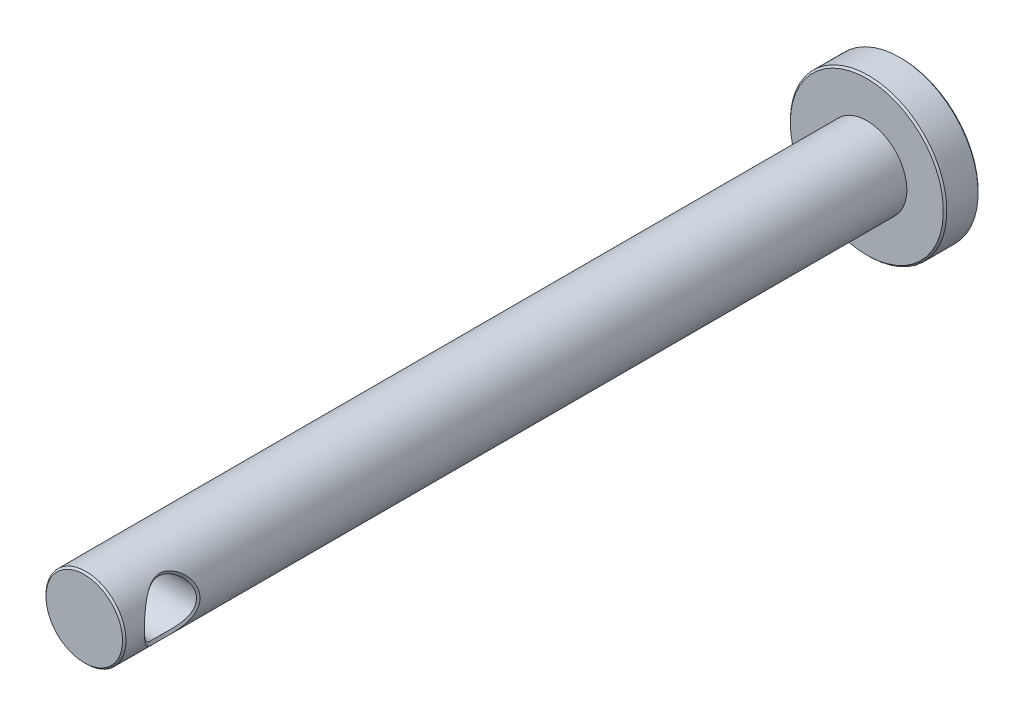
ISO-10303-21;
HEADER;
FILE_DESCRIPTION(('STEP AP214'),'2;1');
FILE_NAME('part.step','',(''),(''),'','','');
FILE_SCHEMA(('AUTOMOTIVE_DESIGN { 1 0 10303 214 1 1 1 1 }'));
ENDSEC;
DATA;
#1=APPLICATION_CONTEXT('core data for automotive mechanical design processes');
#2=APPLICATION_PROTOCOL_DEFINITION('international standard','automotive_design',2000,#1);
#3=PRODUCT_CONTEXT('',#1,'mechanical');
#4=PRODUCT('Part','Part','',(#3));
#5=PRODUCT_RELATED_PRODUCT_CATEGORY('part','',(#4));
#6=PRODUCT_DEFINITION_FORMATION('','',#4);
#7=PRODUCT_DEFINITION_CONTEXT('part definition',#1,'design');
#8=PRODUCT_DEFINITION('design','',#6,#7);
#9=PRODUCT_DEFINITION_SHAPE('','',#8);
#10=(LENGTH_UNIT() NAMED_UNIT(*) SI_UNIT(.MILLI.,.METRE.));
#11=(NAMED_UNIT(*) PLANE_ANGLE_UNIT() SI_UNIT($,.RADIAN.));
#12=(NAMED_UNIT(*) SI_UNIT($,.STERADIAN.) SOLID_ANGLE_UNIT());
#13=UNCERTAINTY_MEASURE_WITH_UNIT(LENGTH_MEASURE(1.E-05),#10,'distance_accuracy_value','');
#14=(GEOMETRIC_REPRESENTATION_CONTEXT(3) GLOBAL_UNCERTAINTY_ASSIGNED_CONTEXT((#13)) GLOBAL_UNIT_ASSIGNED_CONTEXT((#10,
#11,#12)) REPRESENTATION_CONTEXT('',''));
#15=CARTESIAN_POINT('',(0.,0.,0.));
#16=DIRECTION('',(0.,0.,1.));
#17=DIRECTION('',(1.,0.,0.));
#18=AXIS2_PLACEMENT_3D('',#15,#16,#17);
#19=CARTESIAN_POINT('',(0.,0.,450.));
#20=DIRECTION('',(0.,0.,-1.));
#21=DIRECTION('',(-1.,0.,0.));
#22=AXIS2_PLACEMENT_3D('',#19,#20,#21);
#23=CYLINDRICAL_SURFACE('',#22,23.);
#24=CARTESIAN_POINT('',(-23.0000000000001,-5.94576471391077E-13,438.458899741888));
#25=CARTESIAN_POINT('',(-22.9999491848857,0.208837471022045,438.458825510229));
#26=CARTESIAN_POINT('',(-22.9970170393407,0.417667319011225,438.454980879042));
#27=CARTESIAN_POINT('',(-22.985498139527,0.834492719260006,438.4398533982));
#28=CARTESIAN_POINT('',(-22.9769224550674,1.04248910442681,438.42858511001));
#29=CARTESIAN_POINT('',(-22.9542468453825,1.45722256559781,438.398742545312));
#30=CARTESIAN_POINT('',(-22.9401582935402,1.66396135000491,438.380183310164));
#31=CARTESIAN_POINT('',(-22.9065857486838,2.07575850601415,438.335889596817));
#32=CARTESIAN_POINT('',(-22.8871138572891,2.28081959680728,438.310171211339));
#33=CARTESIAN_POINT('',(-22.8429067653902,2.68883882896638,438.25169151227));
#34=CARTESIAN_POINT('',(-22.8181847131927,2.89180091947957,438.218947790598));
#35=CARTESIAN_POINT('',(-22.7635613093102,3.2954510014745,438.146496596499));
#36=CARTESIAN_POINT('',(-22.733667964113,3.49614200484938,438.10679988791));
#37=CARTESIAN_POINT('',(-22.6685414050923,3.89606877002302,438.020133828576));
#38=CARTESIAN_POINT('',(-22.6332840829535,4.0952934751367,437.973131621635));
#39=CARTESIAN_POINT('',(-22.5578084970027,4.49168219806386,437.872247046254));
#40=CARTESIAN_POINT('',(-22.5175759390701,4.68883842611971,437.818344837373));
#41=CARTESIAN_POINT('',(-22.4324853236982,5.08018032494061,437.703998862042));
#42=CARTESIAN_POINT('',(-22.3876283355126,5.27436667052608,437.643556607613));
#43=CARTESIAN_POINT('',(-22.2936589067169,5.65887494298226,437.516514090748));
#44=CARTESIAN_POINT('',(-22.2445619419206,5.84920803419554,437.44993616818));
#45=CARTESIAN_POINT('',(-22.1424243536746,6.22506720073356,437.310923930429));
#46=CARTESIAN_POINT('',(-22.0894131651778,6.41061732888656,437.238533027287));
#47=CARTESIAN_POINT('',(-21.9797296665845,6.77690210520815,437.088162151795));
#48=CARTESIAN_POINT('',(-21.9230818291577,6.95765932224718,437.010219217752));
#49=CARTESIAN_POINT('',(-21.8063497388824,7.31504203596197,436.848879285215));
#50=CARTESIAN_POINT('',(-21.7462737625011,7.49167614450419,436.765495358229));
#51=CARTESIAN_POINT('',(-21.6228362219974,7.8408206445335,436.5932971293));
#52=CARTESIAN_POINT('',(-21.5594786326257,8.0133356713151,436.504489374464));
#53=CARTESIAN_POINT('',(-21.4296802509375,8.35429788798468,436.321541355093));
#54=CARTESIAN_POINT('',(-21.3632398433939,8.52274558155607,436.227401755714));
#55=CARTESIAN_POINT('',(-21.227463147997,8.85561226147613,436.033862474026));
#56=CARTESIAN_POINT('',(-21.1581244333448,9.02002768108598,435.934458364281));
#57=CARTESIAN_POINT('',(-21.0167189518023,9.34494254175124,435.730451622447));
#58=CARTESIAN_POINT('',(-20.944646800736,9.5054331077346,435.625838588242));
#59=CARTESIAN_POINT('',(-20.7978403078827,9.8225059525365,435.411209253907));
#60=CARTESIAN_POINT('',(-20.7230970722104,9.97907150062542,435.301174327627));
#61=CARTESIAN_POINT('',(-20.5714189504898,10.2879558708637,435.076107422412));
#62=CARTESIAN_POINT('',(-20.4944804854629,10.4402668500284,434.961067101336));
#63=CARTESIAN_POINT('',(-20.3388882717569,10.7401874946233,434.726398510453));
#64=CARTESIAN_POINT('',(-20.260235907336,10.887800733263,434.60677388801));
#65=CARTESIAN_POINT('',(-20.1017028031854,11.1778924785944,434.36336921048));
#66=CARTESIAN_POINT('',(-20.0218270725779,11.3203865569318,434.239604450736));
#67=CARTESIAN_POINT('',(-19.8613264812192,11.5997564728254,433.988303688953));
#68=CARTESIAN_POINT('',(-19.7807089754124,11.7366608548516,433.860794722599));
#69=CARTESIAN_POINT('',(-19.6189178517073,12.0050622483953,433.602057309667));
#70=CARTESIAN_POINT('',(-19.5377487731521,12.1365820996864,433.470849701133));
#71=CARTESIAN_POINT('',(-19.3749193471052,12.3947642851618,433.204457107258));
#72=CARTESIAN_POINT('',(-19.2932598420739,12.5214331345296,433.069277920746));
#73=CARTESIAN_POINT('',(-19.1297092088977,12.7698890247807,432.794852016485));
#74=CARTESIAN_POINT('',(-19.0478182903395,12.8916795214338,432.655608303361));
#75=CARTESIAN_POINT('',(-18.884068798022,13.1304032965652,432.373009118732));
#76=CARTESIAN_POINT('',(-18.8022102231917,13.2473367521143,432.229653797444));
#77=CARTESIAN_POINT('',(-18.6387931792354,13.4763527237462,431.938769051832));
#78=CARTESIAN_POINT('',(-18.5572349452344,13.588431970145,431.791236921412));
#79=CARTESIAN_POINT('',(-18.3946605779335,13.8077761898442,431.49195612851));
#80=CARTESIAN_POINT('',(-18.3136453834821,13.9150340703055,431.340201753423));
#81=CARTESIAN_POINT('',(-18.1526282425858,14.1244858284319,431.03231431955));
#82=CARTESIAN_POINT('',(-18.0726279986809,14.2266718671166,430.876175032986));
#83=CARTESIAN_POINT('',(-17.9141335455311,14.4257832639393,430.55985599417));
#84=CARTESIAN_POINT('',(-17.8356391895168,14.5227091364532,430.399676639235));
#85=CARTESIAN_POINT('',(-17.6806650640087,14.7110573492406,430.075611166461));
#86=CARTESIAN_POINT('',(-17.6041819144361,14.8024893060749,429.911732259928));
#87=CARTESIAN_POINT('',(-17.4537724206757,14.9796014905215,429.58058967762));
#88=CARTESIAN_POINT('',(-17.3798381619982,15.0653004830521,429.41333963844));
#89=CARTESIAN_POINT('',(-17.2349388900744,15.2307480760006,429.075852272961));
#90=CARTESIAN_POINT('',(-17.1639608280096,15.3105244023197,428.905634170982));
#91=CARTESIAN_POINT('',(-17.0255850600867,15.4640587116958,428.561599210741));
#92=CARTESIAN_POINT('',(-16.958179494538,15.5378301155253,428.387791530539));
#93=CARTESIAN_POINT('',(-16.82751023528,15.6793498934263,428.036022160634));
#94=CARTESIAN_POINT('',(-16.7642499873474,15.7470932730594,427.858057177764));
#95=CARTESIAN_POINT('',(-16.6422564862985,15.8763847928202,427.498368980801));
#96=CARTESIAN_POINT('',(-16.5835230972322,15.9379331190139,427.31664587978));
#97=CARTESIAN_POINT('',(-16.4711000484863,16.0546104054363,426.949763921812));
#98=CARTESIAN_POINT('',(-16.4174068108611,16.1097439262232,426.764607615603));
#99=CARTESIAN_POINT('',(-16.3155454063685,16.2133823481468,426.391202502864));
#100=CARTESIAN_POINT('',(-16.267370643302,16.2618951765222,426.202957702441));
#101=CARTESIAN_POINT('',(-16.1770365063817,16.3520802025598,425.823714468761));
#102=CARTESIAN_POINT('',(-16.134868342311,16.3937624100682,425.632720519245));
#103=CARTESIAN_POINT('',(-16.0570342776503,16.4700765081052,425.248320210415));
#104=CARTESIAN_POINT('',(-16.0213587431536,16.5047188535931,425.054917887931));
#105=CARTESIAN_POINT('',(-15.9569960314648,16.5667449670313,424.666042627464));
#106=CARTESIAN_POINT('',(-15.9283003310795,16.5941375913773,424.470572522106));
#107=CARTESIAN_POINT('',(-15.8783811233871,16.6414581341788,424.077904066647));
#108=CARTESIAN_POINT('',(-15.857152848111,16.6613908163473,423.880706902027));
#109=CARTESIAN_POINT('',(-15.8226495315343,16.6935880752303,423.484927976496));
#110=CARTESIAN_POINT('',(-15.8093768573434,16.7058503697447,423.286345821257));
#111=CARTESIAN_POINT('',(-15.7912623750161,16.7225058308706,422.888137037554));
#112=CARTESIAN_POINT('',(-15.7864341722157,16.7268862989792,422.688509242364));
#113=CARTESIAN_POINT('',(-15.7856825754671,16.7275819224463,422.289182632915));
#114=CARTESIAN_POINT('',(-15.7897609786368,16.723895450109,422.089483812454));
#115=CARTESIAN_POINT('',(-15.8063844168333,16.7086277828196,421.691003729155));
#116=CARTESIAN_POINT('',(-15.8189188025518,16.6970565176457,421.492221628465));
#117=CARTESIAN_POINT('',(-15.8519639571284,16.6662355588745,421.095932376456));
#118=CARTESIAN_POINT('',(-15.8724745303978,16.6469860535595,420.898425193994));
#119=CARTESIAN_POINT('',(-15.9209865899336,16.6010216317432,420.505045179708));
#120=CARTESIAN_POINT('',(-15.9489943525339,16.5743004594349,420.309173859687));
#121=CARTESIAN_POINT('',(-16.0120191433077,16.5136023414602,419.919423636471));
#122=CARTESIAN_POINT('',(-16.0470456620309,16.4796155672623,419.725547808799));
#123=CARTESIAN_POINT('',(-16.123629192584,16.4045932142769,419.340146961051));
#124=CARTESIAN_POINT('',(-16.1651963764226,16.3635466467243,419.148626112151));
#125=CARTESIAN_POINT('',(-16.2543856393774,16.2746089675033,418.76829468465));
#126=CARTESIAN_POINT('',(-16.3020167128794,16.2267076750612,418.579488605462));
#127=CARTESIAN_POINT('',(-16.4028567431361,16.124264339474,418.204945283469));
#128=CARTESIAN_POINT('',(-16.456072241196,16.0697144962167,418.019211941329));
#129=CARTESIAN_POINT('',(-16.5676168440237,15.9541710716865,417.651180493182));
#130=CARTESIAN_POINT('',(-16.6259492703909,15.893173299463,417.468884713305));
#131=CARTESIAN_POINT('',(-16.7472207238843,15.7649495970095,417.108070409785));
#132=CARTESIAN_POINT('',(-16.8101594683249,15.6977240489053,416.929551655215));
#133=CARTESIAN_POINT('',(-16.9402987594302,15.5571857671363,416.576729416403));
#134=CARTESIAN_POINT('',(-17.0074952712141,15.483878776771,416.402422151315));
#135=CARTESIAN_POINT('',(-17.1453634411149,15.3314136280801,416.057703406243));
#136=CARTESIAN_POINT('',(-17.2160365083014,15.2522530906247,415.887293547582));
#137=CARTESIAN_POINT('',(-17.3601212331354,15.0882650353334,415.54982544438));
#138=CARTESIAN_POINT('',(-17.4335390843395,15.0034243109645,415.382776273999));
#139=CARTESIAN_POINT('',(-17.5828541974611,14.82811550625,415.052197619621));
#140=CARTESIAN_POINT('',(-17.6587569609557,14.7376344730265,414.888677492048));
#141=CARTESIAN_POINT('',(-17.8126226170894,14.5511562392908,414.565227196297));
#142=CARTESIAN_POINT('',(-17.8905898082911,14.4551469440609,414.405306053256));
#143=CARTESIAN_POINT('',(-18.0482082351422,14.2577035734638,414.089150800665));
#144=CARTESIAN_POINT('',(-18.1278626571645,14.1562585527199,413.932925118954));
#145=CARTESIAN_POINT('',(-18.2884678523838,13.9480400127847,413.624251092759));
#146=CARTESIAN_POINT('',(-18.3694207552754,13.8412569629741,413.471810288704));
#147=CARTESIAN_POINT('',(-18.5322381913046,13.6224569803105,413.170798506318));
#148=CARTESIAN_POINT('',(-18.614103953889,13.5104321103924,413.022233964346));
#149=CARTESIAN_POINT('',(-18.7783615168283,13.281243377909,412.729066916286));
#150=CARTESIAN_POINT('',(-18.8607538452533,13.1640732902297,412.584469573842));
#151=CARTESIAN_POINT('',(-19.0256784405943,12.924688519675,412.299329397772));
#152=CARTESIAN_POINT('',(-19.1082107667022,12.8024693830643,412.158790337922));
#153=CARTESIAN_POINT('',(-19.2730308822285,12.5530819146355,411.881859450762));
#154=CARTESIAN_POINT('',(-19.3553185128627,12.4259109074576,411.745469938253));
#155=CARTESIAN_POINT('',(-19.5192573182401,12.1667112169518,411.476930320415));
#156=CARTESIAN_POINT('',(-19.6009083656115,12.0346815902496,411.344781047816));
#157=CARTESIAN_POINT('',(-19.763333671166,11.7656637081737,411.084616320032));
#158=CARTESIAN_POINT('',(-19.8441065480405,11.6286687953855,410.956606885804));
#159=CARTESIAN_POINT('',(-20.0046371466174,11.3496371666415,410.704682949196));
#160=CARTESIAN_POINT('',(-20.0843917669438,11.2075885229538,410.580779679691));
#161=CARTESIAN_POINT('',(-20.2425893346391,10.9185491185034,410.337245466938));
#162=CARTESIAN_POINT('',(-20.3210290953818,10.7715483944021,410.21762427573));
#163=CARTESIAN_POINT('',(-20.476307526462,10.4727085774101,409.982832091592));
#164=CARTESIAN_POINT('',(-20.5531430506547,10.3208612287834,409.8676695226));
#165=CARTESIAN_POINT('',(-20.7049215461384,10.0124311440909,409.641972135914));
#166=CARTESIAN_POINT('',(-20.7798614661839,9.85584156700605,409.531444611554));
#167=CARTESIAN_POINT('',(-20.9275577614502,9.53803055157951,409.315194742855));
#168=CARTESIAN_POINT('',(-21.0003111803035,9.37680337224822,409.209478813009));
#169=CARTESIAN_POINT('',(-21.1433433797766,9.04982097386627,409.003029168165));
#170=CARTESIAN_POINT('',(-21.2136192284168,8.88406077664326,408.902301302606));
#171=CARTESIAN_POINT('',(-21.351405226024,8.5481162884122,408.706004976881));
#172=CARTESIAN_POINT('',(-21.41891231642,8.37792742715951,408.610442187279));
#173=CARTESIAN_POINT('',(-21.5508702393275,8.03323074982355,408.424651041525));
#174=CARTESIAN_POINT('',(-21.6153176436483,7.85871840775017,408.334428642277));
#175=CARTESIAN_POINT('',(-21.7408646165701,7.50547709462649,408.159499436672));
#176=CARTESIAN_POINT('',(-21.8019600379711,7.32674327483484,408.074799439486));
#177=CARTESIAN_POINT('',(-21.920516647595,6.96517355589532,407.911070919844));
#178=CARTESIAN_POINT('',(-21.977972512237,6.78233215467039,407.832050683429));
#179=CARTESIAN_POINT('',(-22.0888172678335,6.41304703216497,407.680105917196));
#180=CARTESIAN_POINT('',(-22.142208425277,6.22660539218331,407.607177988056));
#181=CARTESIAN_POINT('',(-22.2446199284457,5.85056638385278,407.467770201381));
#182=CARTESIAN_POINT('',(-22.2936482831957,5.66097558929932,407.401278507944));
#183=CARTESIAN_POINT('',(-22.3872150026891,5.27866451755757,407.274772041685));
#184=CARTESIAN_POINT('',(-22.4317556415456,5.08594588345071,407.214753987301));
#185=CARTESIAN_POINT('',(-22.5162258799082,4.69739408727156,407.101244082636));
#186=CARTESIAN_POINT('',(-22.556151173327,4.50155820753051,407.047758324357));
#187=CARTESIAN_POINT('',(-22.6312635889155,4.10678740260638,406.947368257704));
#188=CARTESIAN_POINT('',(-22.6664390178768,3.90784612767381,406.900480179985));
#189=CARTESIAN_POINT('',(-22.7319444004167,3.50695560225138,406.813306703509));
#190=CARTESIAN_POINT('',(-22.762256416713,3.30499808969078,406.773045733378));
#191=CARTESIAN_POINT('',(-22.8175280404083,2.89861909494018,406.699723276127));
#192=CARTESIAN_POINT('',(-22.8424766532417,2.69419344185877,406.666676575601));
#193=CARTESIAN_POINT('',(-22.8869851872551,2.28362163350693,406.607795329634));
#194=CARTESIAN_POINT('',(-22.9065424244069,2.07747467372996,406.581964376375));
#195=CARTESIAN_POINT('',(-22.9401856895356,1.6641297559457,406.537580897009));
#196=CARTESIAN_POINT('',(-22.9542763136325,1.45693282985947,406.519022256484));
#197=CARTESIAN_POINT('',(-22.9768985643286,1.0421669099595,406.489253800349));
#198=CARTESIAN_POINT('',(-22.9854422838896,0.834599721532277,406.478027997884));
#199=CARTESIAN_POINT('',(-22.9969570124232,0.419770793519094,406.462915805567));
#200=CARTESIAN_POINT('',(-22.9999475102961,0.212510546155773,406.459003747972));
#201=CARTESIAN_POINT('',(-23.0000512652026,-0.201907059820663,406.458824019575));
#202=CARTESIAN_POINT('',(-22.9971677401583,-0.40906441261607,406.462552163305));
#203=CARTESIAN_POINT('',(-22.9855256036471,-0.823563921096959,406.477671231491));
#204=CARTESIAN_POINT('',(-22.9767490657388,-1.03090470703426,406.489085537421));
#205=CARTESIAN_POINT('',(-22.9535657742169,-1.4452520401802,406.519343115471));
#206=CARTESIAN_POINT('',(-22.9391448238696,-1.65225641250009,406.538205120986));
#207=CARTESIAN_POINT('',(-22.9048386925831,-2.06540800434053,406.58320990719));
#208=CARTESIAN_POINT('',(-22.8849433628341,-2.27155290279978,406.60936621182));
#209=CARTESIAN_POINT('',(-22.8398749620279,-2.68246273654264,406.668789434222));
#210=CARTESIAN_POINT('',(-22.8146961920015,-2.88722593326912,406.702064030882));
#211=CARTESIAN_POINT('',(-22.7592415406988,-3.29484863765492,406.775560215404));
#212=CARTESIAN_POINT('',(-22.7289646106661,-3.49770774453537,406.815783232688));
#213=CARTESIAN_POINT('',(-22.6634950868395,-3.90099743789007,406.903011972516));
#214=CARTESIAN_POINT('',(-22.6283061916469,-4.10142972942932,406.950012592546));
#215=CARTESIAN_POINT('',(-22.55319556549,-4.49934152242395,407.050630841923));
#216=CARTESIAN_POINT('',(-22.5132822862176,-4.6968256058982,407.10423666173));
#217=CARTESIAN_POINT('',(-22.4288987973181,-5.08831077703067,407.217907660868));
#218=CARTESIAN_POINT('',(-22.3844417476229,-5.28232011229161,407.277954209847));
#219=CARTESIAN_POINT('',(-22.291172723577,-5.66634388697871,407.404319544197));
#220=CARTESIAN_POINT('',(-22.2423784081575,-5.85637095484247,407.47061295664));
#221=CARTESIAN_POINT('',(-22.1405401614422,-6.23184657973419,407.609394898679));
#222=CARTESIAN_POINT('',(-22.0875186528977,-6.41731325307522,407.681850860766));
#223=CARTESIAN_POINT('',(-21.9773959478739,-6.78432704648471,407.832876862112));
#224=CARTESIAN_POINT('',(-21.9202977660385,-6.96587693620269,407.91144238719));
#225=CARTESIAN_POINT('',(-21.8023742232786,-7.32584356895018,408.074453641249));
#226=CARTESIAN_POINT('',(-21.7415374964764,-7.50424839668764,408.158917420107));
#227=CARTESIAN_POINT('',(-21.6163948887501,-7.85739479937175,408.333543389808));
#228=CARTESIAN_POINT('',(-21.5520836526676,-8.03213010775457,408.423714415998));
#229=CARTESIAN_POINT('',(-21.4203432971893,-8.37747651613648,408.609468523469));
#230=CARTESIAN_POINT('',(-21.3529144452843,-8.54808796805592,408.705051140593));
#231=CARTESIAN_POINT('',(-21.2152736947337,-8.88471824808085,408.901359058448));
#232=CARTESIAN_POINT('',(-21.1450670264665,-9.05074479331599,409.002074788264));
#233=CARTESIAN_POINT('',(-21.0021841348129,-9.37768554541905,409.208411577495));
#234=CARTESIAN_POINT('',(-20.9295176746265,-9.53861595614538,409.314013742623));
#235=CARTESIAN_POINT('',(-20.7821996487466,-9.85535429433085,409.529620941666));
#236=CARTESIAN_POINT('',(-20.7075584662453,-10.0111819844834,409.639604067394));
#237=CARTESIAN_POINT('',(-20.5564972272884,-10.3177974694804,409.863968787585));
#238=CARTESIAN_POINT('',(-20.4800842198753,-10.4686008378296,409.978333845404));
#239=CARTESIAN_POINT('',(-20.3256859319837,-10.7653043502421,410.211439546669));
#240=CARTESIAN_POINT('',(-20.2477046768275,-10.9112149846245,410.330169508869));
#241=CARTESIAN_POINT('',(-20.0903694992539,-11.1982532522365,410.572000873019));
#242=CARTESIAN_POINT('',(-20.0110173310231,-11.3393863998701,410.695096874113));
#243=CARTESIAN_POINT('',(-19.8511510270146,-11.6170307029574,410.945619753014));
#244=CARTESIAN_POINT('',(-19.7706370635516,-11.7535425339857,411.073045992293));
#245=CARTESIAN_POINT('',(-19.6085022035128,-12.022146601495,411.332501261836));
#246=CARTESIAN_POINT('',(-19.526879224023,-12.1542282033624,411.464540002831));
#247=CARTESIAN_POINT('',(-19.362810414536,-12.4138769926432,411.733258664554));
#248=CARTESIAN_POINT('',(-19.2803630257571,-12.5414319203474,411.869949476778));
#249=CARTESIAN_POINT('',(-19.115163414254,-12.7917302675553,412.147588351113));
#250=CARTESIAN_POINT('',(-19.0324110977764,-12.9144720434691,412.288537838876));
#251=CARTESIAN_POINT('',(-18.8671100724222,-13.1548041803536,412.574345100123));
#252=CARTESIAN_POINT('',(-18.7845612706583,-13.2724036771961,412.719195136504));
#253=CARTESIAN_POINT('',(-18.6201820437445,-13.5021312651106,413.012440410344));
#254=CARTESIAN_POINT('',(-18.5383500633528,-13.614279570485,413.160818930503));
#255=CARTESIAN_POINT('',(-18.375855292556,-13.8328230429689,413.460883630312));
#256=CARTESIAN_POINT('',(-18.2951885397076,-13.9392465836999,413.612546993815));
#257=CARTESIAN_POINT('',(-18.1351839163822,-14.1467646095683,413.919501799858));
#258=CARTESIAN_POINT('',(-18.0558432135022,-14.2478718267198,414.0747831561));
#259=CARTESIAN_POINT('',(-17.8987801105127,-14.4447655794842,414.389117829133));
#260=CARTESIAN_POINT('',(-17.8210555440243,-14.5405595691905,414.548165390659));
#261=CARTESIAN_POINT('',(-17.6675540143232,-14.7267884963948,414.870071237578));
#262=CARTESIAN_POINT('',(-17.5917753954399,-14.8172280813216,415.032926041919));
#263=CARTESIAN_POINT('',(-17.4425394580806,-14.9926795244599,415.362518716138));
#264=CARTESIAN_POINT('',(-17.3690815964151,-15.0776926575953,415.529255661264));
#265=CARTESIAN_POINT('',(-17.2246892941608,-15.242325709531,415.866567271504));
#266=CARTESIAN_POINT('',(-17.1537561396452,-15.3219428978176,416.037143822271));
#267=CARTESIAN_POINT('',(-17.0152631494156,-15.4754289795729,416.38250147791));
#268=CARTESIAN_POINT('',(-16.9477074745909,-15.5492908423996,416.55728739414));
#269=CARTESIAN_POINT('',(-16.8169053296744,-15.6908176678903,416.91109334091));
#270=CARTESIAN_POINT('',(-16.7536618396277,-15.7584783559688,417.090116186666));
#271=CARTESIAN_POINT('',(-16.6318192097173,-15.8874900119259,417.451911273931));
#272=CARTESIAN_POINT('',(-16.5732187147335,-15.9488428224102,417.634682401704));
#273=CARTESIAN_POINT('',(-16.4611707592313,-16.0650226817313,418.003601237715));
#274=CARTESIAN_POINT('',(-16.4077175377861,-16.119857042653,418.189744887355));
#275=CARTESIAN_POINT('',(-16.3064264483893,-16.2228123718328,418.565004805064));
#276=CARTESIAN_POINT('',(-16.2585786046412,-16.2709452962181,418.754115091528));
#277=CARTESIAN_POINT('',(-16.1689727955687,-16.3603035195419,419.134911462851));
#278=CARTESIAN_POINT('',(-16.1272011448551,-16.4015443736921,419.326590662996));
#279=CARTESIAN_POINT('',(-16.0502184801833,-16.4769271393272,419.712124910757));
#280=CARTESIAN_POINT('',(-16.014991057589,-16.5110868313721,419.905973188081));
#281=CARTESIAN_POINT('',(-15.9515668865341,-16.57211737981,420.295445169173));
#282=CARTESIAN_POINT('',(-15.9233525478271,-16.5990064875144,420.49106312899));
#283=CARTESIAN_POINT('',(-15.8744247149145,-16.6453058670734,420.883673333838));
#284=CARTESIAN_POINT('',(-15.8536946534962,-16.664732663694,421.080661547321));
#285=CARTESIAN_POINT('',(-15.8201957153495,-16.6959273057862,421.475609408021));
#286=CARTESIAN_POINT('',(-15.8074142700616,-16.7077072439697,421.673567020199));
#287=CARTESIAN_POINT('',(-15.7902978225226,-16.7234023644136,422.07005476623));
#288=CARTESIAN_POINT('',(-15.7859579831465,-16.7273220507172,422.268584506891));
#289=CARTESIAN_POINT('',(-15.7861013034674,-16.7272003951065,422.665494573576));
#290=CARTESIAN_POINT('',(-15.7905781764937,-16.7231647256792,422.863874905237));
#291=CARTESIAN_POINT('',(-15.8078426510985,-16.7073655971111,423.25981353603));
#292=CARTESIAN_POINT('',(-15.8206243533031,-16.6956076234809,423.457372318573));
#293=CARTESIAN_POINT('',(-15.85406560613,-16.6645142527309,423.851330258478));
#294=CARTESIAN_POINT('',(-15.8747296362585,-16.6451745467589,424.047728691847));
#295=CARTESIAN_POINT('',(-15.9234791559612,-16.5990930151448,424.439026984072));
#296=CARTESIAN_POINT('',(-15.9515758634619,-16.5723399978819,424.633924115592));
#297=CARTESIAN_POINT('',(-16.0147453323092,-16.511596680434,425.021882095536));
#298=CARTESIAN_POINT('',(-16.049833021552,-16.4775908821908,425.214938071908));
#299=CARTESIAN_POINT('',(-16.1265396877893,-16.4025064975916,425.598875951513));
#300=CARTESIAN_POINT('',(-16.1681748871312,-16.3614103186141,425.789751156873));
#301=CARTESIAN_POINT('',(-16.257535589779,-16.272306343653,426.168988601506));
#302=CARTESIAN_POINT('',(-16.3052767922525,-16.2242806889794,426.357342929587));
#303=CARTESIAN_POINT('',(-16.4064063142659,-16.121479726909,426.731201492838));
#304=CARTESIAN_POINT('',(-16.4598085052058,-16.0666877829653,426.916697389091));
#305=CARTESIAN_POINT('',(-16.5718319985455,-15.9505057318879,427.284491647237));
#306=CARTESIAN_POINT('',(-16.6304645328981,-15.8891013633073,427.466782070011));
#307=CARTESIAN_POINT('',(-16.7524690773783,-15.7598786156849,427.827852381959));
#308=CARTESIAN_POINT('',(-16.8158491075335,-15.6920493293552,428.006625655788));
#309=CARTESIAN_POINT('',(-16.9470653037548,-15.5500336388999,428.360215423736));
#310=CARTESIAN_POINT('',(-17.0149063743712,-15.4758402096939,428.535027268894));
#311=CARTESIAN_POINT('',(-17.1539997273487,-15.3216573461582,428.880669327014));
#312=CARTESIAN_POINT('',(-17.2252519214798,-15.2416680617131,429.051499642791));
#313=CARTESIAN_POINT('',(-17.3702024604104,-15.0763599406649,429.389417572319));
#314=CARTESIAN_POINT('',(-17.4438999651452,-14.9910429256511,429.55650643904));
#315=CARTESIAN_POINT('',(-17.5935619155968,-14.8150185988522,429.886835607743));
#316=CARTESIAN_POINT('',(-17.6695268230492,-14.7243101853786,430.050075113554));
#317=CARTESIAN_POINT('',(-17.8233506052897,-14.5375663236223,430.372736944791));
#318=CARTESIAN_POINT('',(-17.9012107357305,-14.441527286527,430.532156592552));
#319=CARTESIAN_POINT('',(-18.0585045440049,-14.2441516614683,430.847173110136));
#320=CARTESIAN_POINT('',(-18.1379398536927,-14.1428093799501,431.002765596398));
#321=CARTESIAN_POINT('',(-18.298050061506,-13.9348652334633,431.310131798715));
#322=CARTESIAN_POINT('',(-18.3787265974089,-13.8282559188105,431.46189961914));
#323=CARTESIAN_POINT('',(-18.5409893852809,-13.6098131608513,431.76161787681));
#324=CARTESIAN_POINT('',(-18.6225769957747,-13.4979707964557,431.909561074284));
#325=CARTESIAN_POINT('',(-18.7863312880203,-13.2690969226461,432.20163119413));
#326=CARTESIAN_POINT('',(-18.8684988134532,-13.1520552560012,432.34574968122));
#327=CARTESIAN_POINT('',(-19.0330829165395,-12.9128204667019,432.630174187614));
#328=CARTESIAN_POINT('',(-19.1154996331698,-12.7906161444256,432.770470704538));
#329=CARTESIAN_POINT('',(-19.2802516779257,-12.541081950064,433.047243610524));
#330=CARTESIAN_POINT('',(-19.3625862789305,-12.413739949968,433.1837094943));
#331=CARTESIAN_POINT('',(-19.5268457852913,-12.1539997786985,433.452856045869));
#332=CARTESIAN_POINT('',(-19.6087689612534,-12.0215887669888,433.585525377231));
#333=CARTESIAN_POINT('',(-19.7717777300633,-11.7517692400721,433.846805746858));
#334=CARTESIAN_POINT('',(-19.8528615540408,-11.614352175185,433.975409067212));
#335=CARTESIAN_POINT('',(-20.0138348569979,-11.3346068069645,434.22816228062));
#336=CARTESIAN_POINT('',(-20.0937235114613,-11.1922753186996,434.352309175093));
#337=CARTESIAN_POINT('',(-20.2520429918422,-10.9028218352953,434.596057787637));
#338=CARTESIAN_POINT('',(-20.330472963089,-10.7556971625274,434.715656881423));
#339=CARTESIAN_POINT('',(-20.4856091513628,-10.4567350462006,434.950174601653));
#340=CARTESIAN_POINT('',(-20.5623144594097,-10.3048952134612,435.065090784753));
#341=CARTESIAN_POINT('',(-20.7137360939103,-9.99659229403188,435.290119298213));
#342=CARTESIAN_POINT('',(-20.7884513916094,-9.84012690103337,435.400229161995));
#343=CARTESIAN_POINT('',(-20.9356276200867,-9.52265942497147,435.615518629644));
#344=CARTESIAN_POINT('',(-21.0080872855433,-9.36165488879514,435.720695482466));
#345=CARTESIAN_POINT('',(-21.150487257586,-9.03519696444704,435.925993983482));
#346=CARTESIAN_POINT('',(-21.2204258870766,-8.86974073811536,436.026112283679));
#347=CARTESIAN_POINT('',(-21.3575181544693,-8.53446647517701,436.221167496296));
#348=CARTESIAN_POINT('',(-21.4246694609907,-8.36464497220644,436.31610009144));
#349=CARTESIAN_POINT('',(-21.5559247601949,-8.02073051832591,436.500663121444));
#350=CARTESIAN_POINT('',(-21.6200254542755,-7.84663323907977,436.590287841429));
#351=CARTESIAN_POINT('',(-21.7449061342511,-7.49424651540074,436.764096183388));
#352=CARTESIAN_POINT('',(-21.8056814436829,-7.31595164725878,436.848272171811));
#353=CARTESIAN_POINT('',(-21.9236810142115,-6.95529148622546,437.011114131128));
#354=CARTESIAN_POINT('',(-21.9808988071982,-6.77291955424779,437.08977009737));
#355=CARTESIAN_POINT('',(-22.0913345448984,-6.40426748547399,437.241162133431));
#356=CARTESIAN_POINT('',(-22.1445477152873,-6.21798301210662,437.313891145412));
#357=CARTESIAN_POINT('',(-22.2466329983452,-5.841831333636,437.453012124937));
#358=CARTESIAN_POINT('',(-22.2955039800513,-5.65196321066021,437.519402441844));
#359=CARTESIAN_POINT('',(-22.3887804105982,-5.26896810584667,437.645768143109));
#360=CARTESIAN_POINT('',(-22.4331847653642,-5.07584033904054,437.70574195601));
#361=CARTESIAN_POINT('',(-22.5173602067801,-4.68660942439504,437.819126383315));
#362=CARTESIAN_POINT('',(-22.5571300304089,-4.49050548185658,437.87253520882));
#363=CARTESIAN_POINT('',(-22.6318805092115,-4.09561668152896,437.972660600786));
#364=CARTESIAN_POINT('',(-22.6668594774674,-3.89683090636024,438.01937481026));
#365=CARTESIAN_POINT('',(-22.731869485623,-3.49687009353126,438.105977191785));
#366=CARTESIAN_POINT('',(-22.7618980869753,-3.29569393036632,438.14586200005));
#367=CARTESIAN_POINT('',(-22.8168497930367,-2.89124487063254,438.218673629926));
#368=CARTESIAN_POINT('',(-22.8417693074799,-2.68797060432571,438.251595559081));
#369=CARTESIAN_POINT('',(-22.8863453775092,-2.27961758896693,438.310349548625));
#370=CARTESIAN_POINT('',(-22.9059967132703,-2.07453725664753,438.336174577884));
#371=CARTESIAN_POINT('',(-22.9398798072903,-1.66286470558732,438.38060396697));
#372=CARTESIAN_POINT('',(-22.9541041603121,-1.4562708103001,438.399198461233));
#373=CARTESIAN_POINT('',(-22.9769761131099,-1.04186231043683,438.429035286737));
#374=CARTESIAN_POINT('',(-22.9856134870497,-0.834046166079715,438.440264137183));
#375=CARTESIAN_POINT('',(-22.9971590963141,-0.417488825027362,438.455244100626));
#376=CARTESIAN_POINT('',(-23.0000535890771,-0.208746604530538,438.458977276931));
#377=CARTESIAN_POINT('',(-23.0000000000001,-5.94576471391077E-13,438.458899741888));
#378=B_SPLINE_CURVE_WITH_KNOTS('',3,(#24,#25,#26,#27,#28,#29,#30,#31,#32,#33,#34,#35,#36,#37,
#38,#39,#40,#41,#42,#43,#44,#45,#46,#47,#48,#49,#50,#51,#52,#53,#54,#55,#56,#57,#58,#59,#60,#61,
#62,#63,#64,#65,#66,#67,#68,#69,#70,#71,#72,#73,#74,#75,#76,#77,#78,#79,#80,#81,#82,#83,#84,#85,
#86,#87,#88,#89,#90,#91,#92,#93,#94,#95,#96,#97,#98,#99,#100,#101,#102,#103,#104,#105,#106,#107,
#108,#109,#110,#111,#112,#113,#114,#115,#116,#117,#118,#119,#120,#121,#122,#123,#124,#125,#126,
#127,#128,#129,#130,#131,#132,#133,#134,#135,#136,#137,#138,#139,#140,#141,#142,#143,#144,#145,
#146,#147,#148,#149,#150,#151,#152,#153,#154,#155,#156,#157,#158,#159,#160,#161,#162,#163,#164,
#165,#166,#167,#168,#169,#170,#171,#172,#173,#174,#175,#176,#177,#178,#179,#180,#181,#182,#183,
#184,#185,#186,#187,#188,#189,#190,#191,#192,#193,#194,#195,#196,#197,#198,#199,#200,#201,#202,
#203,#204,#205,#206,#207,#208,#209,#210,#211,#212,#213,#214,#215,#216,#217,#218,#219,#220,#221,
#222,#223,#224,#225,#226,#227,#228,#229,#230,#231,#232,#233,#234,#235,#236,#237,#238,#239,#240,
#241,#242,#243,#244,#245,#246,#247,#248,#249,#250,#251,#252,#253,#254,#255,#256,#257,#258,#259,
#260,#261,#262,#263,#264,#265,#266,#267,#268,#269,#270,#271,#272,#273,#274,#275,#276,#277,#278,
#279,#280,#281,#282,#283,#284,#285,#286,#287,#288,#289,#290,#291,#292,#293,#294,#295,#296,#297,
#298,#299,#300,#301,#302,#303,#304,#305,#306,#307,#308,#309,#310,#311,#312,#313,#314,#315,#316,
#317,#318,#319,#320,#321,#322,#323,#324,#325,#326,#327,#328,#329,#330,#331,#332,#333,#334,#335,
#336,#337,#338,#339,#340,#341,#342,#343,#344,#345,#346,#347,#348,#349,#350,#351,#352,#353,#354,
#355,#356,#357,#358,#359,#360,#361,#362,#363,#364,#365,#366,#367,#368,#369,#370,#371,#372,#373,
#374,#375,#376,#377),.UNSPECIFIED.,.F.,.F.,(4,2,2,2,2,2,2,2,2,2,2,2,2,2,2,2,2,2,2,2,2,2,2,2,2,2,
2,2,2,2,2,2,2,2,2,2,2,2,2,2,2,2,2,2,2,2,2,2,2,2,2,2,2,2,2,2,2,2,2,2,2,2,2,2,2,2,2,2,2,2,2,2,2,2,
2,2,2,2,2,2,2,2,2,2,2,2,2,2,2,2,2,2,2,2,2,2,2,2,2,2,2,2,2,2,2,2,2,2,2,2,2,2,2,2,2,2,2,2,2,2,2,2,
2,2,2,2,2,2,2,2,2,2,2,2,2,2,2,2,2,2,2,2,2,2,2,2,2,2,2,2,2,2,2,2,2,2,2,2,2,2,2,2,2,2,2,2,2,2,2,2,
2,2,2,2,2,2,4),(0.,0.626450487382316,1.25167583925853,1.87561805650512,2.49816891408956,
3.1191786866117,3.73923544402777,4.36216619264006,4.98693015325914,5.61154997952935,
6.23397923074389,6.85212905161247,7.46648416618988,8.07941412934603,8.69161831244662,
9.30374628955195,9.91639750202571,10.5303254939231,11.1465338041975,11.7638117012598,
12.3806082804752,12.9953345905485,13.6063780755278,14.2144827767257,14.8217398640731,
15.4285588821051,16.0353557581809,16.6425551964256,17.2506204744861,17.8595980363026,
18.4685159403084,19.07633492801,19.6820557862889,20.2847341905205,20.8860263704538,
21.4878121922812,22.0895799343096,22.6909172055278,23.2915280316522,23.891250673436,
24.490076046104,25.088166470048,25.6858743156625,26.2837599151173,26.8826079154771,
27.481576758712,28.07979267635,28.677993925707,29.2766975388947,29.8762162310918,
30.4766766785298,31.0780383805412,31.6801125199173,32.2825804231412,32.8850113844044,
33.4868797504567,34.0889941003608,34.6925605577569,35.2975681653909,35.9039537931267,
36.5116100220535,37.1203928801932,37.7301294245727,38.3406251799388,38.9516714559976,
39.5630525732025,40.1745530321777,40.7869061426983,41.4008153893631,42.0160437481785,
42.6323827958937,43.2496578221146,43.86773299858,44.4865166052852,45.1059663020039,
45.7260944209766,46.3469732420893,46.9687401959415,47.5901578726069,48.2104101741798,
48.8303465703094,49.4508567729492,50.0728677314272,50.6971225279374,51.3226450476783,
51.9484784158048,52.5737844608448,53.1977226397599,53.8194669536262,54.4408707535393,
55.0641734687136,55.6890540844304,56.3151010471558,56.9418267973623,57.568681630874,
58.1950669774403,58.8203482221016,59.4438672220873,60.0649546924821,60.6829426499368,
61.30047825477,61.9199943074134,62.5404940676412,63.160940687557,63.7802700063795,
64.3973774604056,65.0117129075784,65.6239226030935,66.2347226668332,66.844791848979,
67.4547714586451,68.0661234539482,68.6790213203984,69.292126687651,69.9040944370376,
70.5135858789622,71.119708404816,71.7243062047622,72.3280331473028,72.9312281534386,
73.5342809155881,74.1376365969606,74.7417181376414,75.3462129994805,75.9505307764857,
76.554164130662,77.1567063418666,77.7578697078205,78.3575047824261,78.9556203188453,
79.5524036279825,80.1482408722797,80.7437365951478,81.3388078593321,81.9334568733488,
82.5284443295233,83.1243349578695,83.7215119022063,84.3201924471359,84.9204444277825,
85.5222028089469,86.1252860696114,86.729412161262,87.3342139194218,87.9390000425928,
88.5435805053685,89.1482849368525,89.7534015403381,90.359181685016,90.9658446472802,
91.5735824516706,92.1825647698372,92.792943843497,93.4048594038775,94.0184435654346,
94.6331298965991,95.2482223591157,95.8636645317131,96.4794238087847,97.0954954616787,
97.7119066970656,98.3287206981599,98.9460406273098,99.5640135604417,100.182834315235,
100.80274912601,101.423391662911,102.044195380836,102.665150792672,103.286275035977,
103.90761742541,104.529264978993,105.151347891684,105.774044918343,106.397588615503,
107.022270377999,107.648445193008),.UNSPECIFIED.);
#379=CARTESIAN_POINT('',(-23.0000000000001,-5.94576471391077E-13,438.458899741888));
#380=VERTEX_POINT('',#379);
#381=EDGE_CURVE('E104',#380,#380,#378,.F.);
#382=ORIENTED_EDGE('',*,*,#381,.T.);
#383=EDGE_LOOP('',(#382));
#384=FACE_BOUND('',#383,.T.);
#385=CARTESIAN_POINT('',(23.0000000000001,0.,406.458913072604));
#386=CARTESIAN_POINT('',(22.9999491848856,0.208837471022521,406.458987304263));
#387=CARTESIAN_POINT('',(22.9970170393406,0.417667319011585,406.462831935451));
#388=CARTESIAN_POINT('',(22.9854981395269,0.834492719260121,406.477959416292));
#389=CARTESIAN_POINT('',(22.9769224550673,1.0424891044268,406.489227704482));
#390=CARTESIAN_POINT('',(22.9542468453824,1.45722256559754,406.51907026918));
#391=CARTESIAN_POINT('',(22.9401582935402,1.66396135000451,406.537629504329));
#392=CARTESIAN_POINT('',(22.9065857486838,2.0757585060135,406.581923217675));
#393=CARTESIAN_POINT('',(22.8871138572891,2.28081959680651,406.607641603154));
#394=CARTESIAN_POINT('',(22.8429067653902,2.68883882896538,406.666121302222));
#395=CARTESIAN_POINT('',(22.8181847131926,2.89180091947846,406.698865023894));
#396=CARTESIAN_POINT('',(22.7635613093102,3.29545100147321,406.771316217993));
#397=CARTESIAN_POINT('',(22.733667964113,3.49614200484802,406.811012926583));
#398=CARTESIAN_POINT('',(22.6685414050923,3.89606877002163,406.897678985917));
#399=CARTESIAN_POINT('',(22.6332840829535,4.09529347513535,406.944681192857));
#400=CARTESIAN_POINT('',(22.5578084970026,4.49168219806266,407.045565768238));
#401=CARTESIAN_POINT('',(22.5175759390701,4.68883842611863,407.09946797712));
#402=CARTESIAN_POINT('',(22.4324853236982,5.08018032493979,407.21381395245));
#403=CARTESIAN_POINT('',(22.3876283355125,5.27436667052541,407.274256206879));
#404=CARTESIAN_POINT('',(22.2936589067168,5.65887494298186,407.401298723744));
#405=CARTESIAN_POINT('',(22.2445619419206,5.84920803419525,407.467876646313));
#406=CARTESIAN_POINT('',(22.1424243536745,6.22506720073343,407.606888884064));
#407=CARTESIAN_POINT('',(22.0894131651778,6.4106173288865,407.679279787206));
#408=CARTESIAN_POINT('',(21.9797296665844,6.77690210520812,407.829650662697));
#409=CARTESIAN_POINT('',(21.9230818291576,6.95765932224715,407.907593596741));
#410=CARTESIAN_POINT('',(21.8063497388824,7.31504203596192,408.068933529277));
#411=CARTESIAN_POINT('',(21.7462737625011,7.49167614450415,408.152317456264));
#412=CARTESIAN_POINT('',(21.6228362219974,7.84082064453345,408.324515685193));
#413=CARTESIAN_POINT('',(21.5594786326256,8.01333567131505,408.413323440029));
#414=CARTESIAN_POINT('',(21.4296802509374,8.35429788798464,408.5962714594));
#415=CARTESIAN_POINT('',(21.3632398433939,8.52274558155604,408.690411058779));
#416=CARTESIAN_POINT('',(21.2274631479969,8.8556122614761,408.883950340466));
#417=CARTESIAN_POINT('',(21.1581244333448,9.02002768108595,408.983354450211));
#418=CARTESIAN_POINT('',(21.0167189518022,9.3449425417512,409.187361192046));
#419=CARTESIAN_POINT('',(20.9446468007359,9.50543310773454,409.29197422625));
#420=CARTESIAN_POINT('',(20.7978403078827,9.82250595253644,409.506603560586));
#421=CARTESIAN_POINT('',(20.7230970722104,9.97907150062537,409.616638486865));
#422=CARTESIAN_POINT('',(20.5714189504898,10.2879558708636,409.84170539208));
#423=CARTESIAN_POINT('',(20.4944804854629,10.4402668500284,409.956745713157));
#424=CARTESIAN_POINT('',(20.3388882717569,10.7401874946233,410.19141430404));
#425=CARTESIAN_POINT('',(20.2602359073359,10.887800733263,410.311038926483));
#426=CARTESIAN_POINT('',(20.1017028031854,11.1778924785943,410.554443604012));
#427=CARTESIAN_POINT('',(20.0218270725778,11.3203865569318,410.678208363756));
#428=CARTESIAN_POINT('',(19.8613264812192,11.5997564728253,410.929509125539));
#429=CARTESIAN_POINT('',(19.7807089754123,11.7366608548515,411.057018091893));
#430=CARTESIAN_POINT('',(19.6189178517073,12.0050622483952,411.315755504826));
#431=CARTESIAN_POINT('',(19.537748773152,12.1365820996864,411.446963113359));
#432=CARTESIAN_POINT('',(19.3749193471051,12.3947642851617,411.713355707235));
#433=CARTESIAN_POINT('',(19.2932598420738,12.5214331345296,411.848534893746));
#434=CARTESIAN_POINT('',(19.1297092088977,12.7698890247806,412.122960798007));
#435=CARTESIAN_POINT('',(19.0478182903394,12.8916795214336,412.262204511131));
#436=CARTESIAN_POINT('',(18.884068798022,13.130403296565,412.54480369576));
#437=CARTESIAN_POINT('',(18.8022102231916,13.2473367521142,412.688159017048));
#438=CARTESIAN_POINT('',(18.6387931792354,13.4763527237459,412.97904376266));
#439=CARTESIAN_POINT('',(18.5572349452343,13.5884319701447,413.12657589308));
#440=CARTESIAN_POINT('',(18.3946605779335,13.8077761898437,413.425856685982));
#441=CARTESIAN_POINT('',(18.3136453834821,13.9150340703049,413.577611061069));
#442=CARTESIAN_POINT('',(18.1526282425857,14.1244858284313,413.885498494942));
#443=CARTESIAN_POINT('',(18.0726279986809,14.2266718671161,414.041637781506));
#444=CARTESIAN_POINT('',(17.914133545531,14.4257832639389,414.357956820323));
#445=CARTESIAN_POINT('',(17.8356391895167,14.522709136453,414.518136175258));
#446=CARTESIAN_POINT('',(17.6806650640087,14.7110573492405,414.842201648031));
#447=CARTESIAN_POINT('',(17.6041819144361,14.802489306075,415.006080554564));
#448=CARTESIAN_POINT('',(17.4537724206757,14.9796014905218,415.337223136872));
#449=CARTESIAN_POINT('',(17.3798381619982,15.0653004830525,415.504473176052));
#450=CARTESIAN_POINT('',(17.2349388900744,15.2307480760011,415.841960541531));
#451=CARTESIAN_POINT('',(17.1639608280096,15.3105244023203,416.012178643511));
#452=CARTESIAN_POINT('',(17.0255850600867,15.4640587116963,416.356213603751));
#453=CARTESIAN_POINT('',(16.958179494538,15.5378301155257,416.530021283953));
#454=CARTESIAN_POINT('',(16.82751023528,15.6793498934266,416.881790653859));
#455=CARTESIAN_POINT('',(16.7642499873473,15.7470932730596,417.059755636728));
#456=CARTESIAN_POINT('',(16.6422564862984,15.8763847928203,417.419443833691));
#457=CARTESIAN_POINT('',(16.5835230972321,15.937933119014,417.601166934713));
#458=CARTESIAN_POINT('',(16.4711000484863,16.0546104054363,417.96804889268));
#459=CARTESIAN_POINT('',(16.4174068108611,16.1097439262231,418.153205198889));
#460=CARTESIAN_POINT('',(16.3155454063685,16.2133823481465,418.526610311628));
#461=CARTESIAN_POINT('',(16.2673706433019,16.2618951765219,418.714855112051));
#462=CARTESIAN_POINT('',(16.1770365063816,16.3520802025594,419.094098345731));
#463=CARTESIAN_POINT('',(16.134868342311,16.3937624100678,419.285092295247));
#464=CARTESIAN_POINT('',(16.0570342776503,16.4700765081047,419.669492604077));
#465=CARTESIAN_POINT('',(16.0213587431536,16.5047188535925,419.862894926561));
#466=CARTESIAN_POINT('',(15.9569960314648,16.5667449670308,420.251770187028));
#467=CARTESIAN_POINT('',(15.9283003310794,16.5941375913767,420.447240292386));
#468=CARTESIAN_POINT('',(15.8783811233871,16.6414581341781,420.839908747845));
#469=CARTESIAN_POINT('',(15.857152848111,16.6613908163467,421.037105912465));
#470=CARTESIAN_POINT('',(15.8226495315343,16.6935880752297,421.432884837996));
#471=CARTESIAN_POINT('',(15.8093768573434,16.7058503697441,421.631466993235));
#472=CARTESIAN_POINT('',(15.7912623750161,16.72250583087,422.029675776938));
#473=CARTESIAN_POINT('',(15.7864341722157,16.7268862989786,422.229303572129));
#474=CARTESIAN_POINT('',(15.7856825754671,16.7275819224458,422.628630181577));
#475=CARTESIAN_POINT('',(15.7897609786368,16.7238954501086,422.828329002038));
#476=CARTESIAN_POINT('',(15.8063844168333,16.7086277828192,423.226809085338));
#477=CARTESIAN_POINT('',(15.8189188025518,16.6970565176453,423.425591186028));
#478=CARTESIAN_POINT('',(15.8519639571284,16.6662355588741,423.821880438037));
#479=CARTESIAN_POINT('',(15.8724745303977,16.6469860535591,424.019387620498));
#480=CARTESIAN_POINT('',(15.9209865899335,16.6010216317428,424.412767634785));
#481=CARTESIAN_POINT('',(15.9489943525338,16.5743004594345,424.608638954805));
#482=CARTESIAN_POINT('',(16.0120191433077,16.5136023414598,424.998389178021));
#483=CARTESIAN_POINT('',(16.0470456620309,16.4796155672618,425.192265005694));
#484=CARTESIAN_POINT('',(16.123629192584,16.4045932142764,425.577665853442));
#485=CARTESIAN_POINT('',(16.1651963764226,16.3635466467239,425.769186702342));
#486=CARTESIAN_POINT('',(16.2543856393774,16.2746089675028,426.149518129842));
#487=CARTESIAN_POINT('',(16.3020167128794,16.2267076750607,426.33832420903));
#488=CARTESIAN_POINT('',(16.4028567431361,16.1242643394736,426.712867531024));
#489=CARTESIAN_POINT('',(16.4560722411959,16.0697144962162,426.898600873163));
#490=CARTESIAN_POINT('',(16.5676168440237,15.9541710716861,427.26663232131));
#491=CARTESIAN_POINT('',(16.6259492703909,15.8931732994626,427.448928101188));
#492=CARTESIAN_POINT('',(16.7472207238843,15.7649495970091,427.809742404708));
#493=CARTESIAN_POINT('',(16.8101594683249,15.6977240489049,427.988261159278));
#494=CARTESIAN_POINT('',(16.9402987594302,15.5571857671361,428.34108339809));
#495=CARTESIAN_POINT('',(17.0074952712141,15.4838787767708,428.515390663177));
#496=CARTESIAN_POINT('',(17.1453634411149,15.3314136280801,428.86010940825));
#497=CARTESIAN_POINT('',(17.2160365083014,15.2522530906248,429.03051926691));
#498=CARTESIAN_POINT('',(17.3601212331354,15.0882650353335,429.367987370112));
#499=CARTESIAN_POINT('',(17.4335390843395,15.0034243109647,429.535036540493));
#500=CARTESIAN_POINT('',(17.5828541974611,14.8281155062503,429.865615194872));
#501=CARTESIAN_POINT('',(17.6587569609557,14.7376344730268,430.029135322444));
#502=CARTESIAN_POINT('',(17.8126226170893,14.5511562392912,430.352585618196));
#503=CARTESIAN_POINT('',(17.8905898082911,14.4551469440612,430.512506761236));
#504=CARTESIAN_POINT('',(18.0482082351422,14.2577035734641,430.828662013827));
#505=CARTESIAN_POINT('',(18.1278626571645,14.1562585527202,430.984887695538));
#506=CARTESIAN_POINT('',(18.2884678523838,13.9480400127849,431.293561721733));
#507=CARTESIAN_POINT('',(18.3694207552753,13.8412569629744,431.446002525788));
#508=CARTESIAN_POINT('',(18.5322381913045,13.6224569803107,431.747014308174));
#509=CARTESIAN_POINT('',(18.614103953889,13.5104321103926,431.895578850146));
#510=CARTESIAN_POINT('',(18.7783615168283,13.2812433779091,432.188745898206));
#511=CARTESIAN_POINT('',(18.8607538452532,13.1640732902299,432.33334324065));
#512=CARTESIAN_POINT('',(19.0256784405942,12.924688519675,432.61848341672));
#513=CARTESIAN_POINT('',(19.1082107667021,12.8024693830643,432.75902247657));
#514=CARTESIAN_POINT('',(19.2730308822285,12.5530819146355,433.03595336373));
#515=CARTESIAN_POINT('',(19.3553185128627,12.4259109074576,433.172342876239));
#516=CARTESIAN_POINT('',(19.5192573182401,12.1667112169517,433.440882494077));
#517=CARTESIAN_POINT('',(19.6009083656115,12.0346815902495,433.573031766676));
#518=CARTESIAN_POINT('',(19.7633336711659,11.7656637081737,433.83319649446));
#519=CARTESIAN_POINT('',(19.8441065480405,11.6286687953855,433.961205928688));
#520=CARTESIAN_POINT('',(20.0046371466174,11.3496371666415,434.213129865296));
#521=CARTESIAN_POINT('',(20.0843917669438,11.2075885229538,434.337033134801));
#522=CARTESIAN_POINT('',(20.2425893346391,10.9185491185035,434.580567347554));
#523=CARTESIAN_POINT('',(20.3210290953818,10.7715483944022,434.700188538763));
#524=CARTESIAN_POINT('',(20.4763075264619,10.4727085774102,434.9349807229));
#525=CARTESIAN_POINT('',(20.5531430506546,10.3208612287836,435.050143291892));
#526=CARTESIAN_POINT('',(20.7049215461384,10.0124311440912,435.275840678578));
#527=CARTESIAN_POINT('',(20.7798614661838,9.85584156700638,435.386368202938));
#528=CARTESIAN_POINT('',(20.9275577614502,9.53803055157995,435.602618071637));
#529=CARTESIAN_POINT('',(21.0003111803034,9.37680337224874,435.708334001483));
#530=CARTESIAN_POINT('',(21.1433433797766,9.04982097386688,435.914783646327));
#531=CARTESIAN_POINT('',(21.2136192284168,8.88406077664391,436.015511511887));
#532=CARTESIAN_POINT('',(21.351405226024,8.548116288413,436.211807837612));
#533=CARTESIAN_POINT('',(21.4189123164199,8.37792742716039,436.307370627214));
#534=CARTESIAN_POINT('',(21.5508702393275,8.03323074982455,436.493161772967));
#535=CARTESIAN_POINT('',(21.6153176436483,7.8587184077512,436.583384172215));
#536=CARTESIAN_POINT('',(21.74086461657,7.50547709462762,436.75831337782));
#537=CARTESIAN_POINT('',(21.8019600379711,7.32674327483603,436.843013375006));
#538=CARTESIAN_POINT('',(21.920516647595,6.96517355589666,437.006741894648));
#539=CARTESIAN_POINT('',(21.977972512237,6.78233215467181,437.085762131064));
#540=CARTESIAN_POINT('',(22.0888172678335,6.41304703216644,437.237706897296));
#541=CARTESIAN_POINT('',(22.142208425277,6.22660539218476,437.310634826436));
#542=CARTESIAN_POINT('',(22.2446199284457,5.85056638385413,437.450042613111));
#543=CARTESIAN_POINT('',(22.2936482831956,5.66097558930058,437.516534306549));
#544=CARTESIAN_POINT('',(22.3872150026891,5.2786645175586,437.643040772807));
#545=CARTESIAN_POINT('',(22.4317556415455,5.08594588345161,437.703058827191));
#546=CARTESIAN_POINT('',(22.5162258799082,4.69739408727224,437.816568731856));
#547=CARTESIAN_POINT('',(22.5561511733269,4.50155820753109,437.870054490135));
#548=CARTESIAN_POINT('',(22.6312635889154,4.10678740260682,437.970444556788));
#549=CARTESIAN_POINT('',(22.6664390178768,3.90784612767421,438.017332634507));
#550=CARTESIAN_POINT('',(22.7319444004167,3.50695560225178,438.104506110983));
#551=CARTESIAN_POINT('',(22.762256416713,3.30499808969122,438.144767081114));
#552=CARTESIAN_POINT('',(22.8175280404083,2.89861909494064,438.218089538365));
#553=CARTESIAN_POINT('',(22.8424766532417,2.69419344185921,438.251136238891));
#554=CARTESIAN_POINT('',(22.886985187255,2.28362163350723,438.310017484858));
#555=CARTESIAN_POINT('',(22.9065424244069,2.07747467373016,438.335848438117));
#556=CARTESIAN_POINT('',(22.9401856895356,1.66412975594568,438.380231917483));
#557=CARTESIAN_POINT('',(22.9542763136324,1.45693282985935,438.398790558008));
#558=CARTESIAN_POINT('',(22.9768985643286,1.04216690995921,438.428559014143));
#559=CARTESIAN_POINT('',(22.9854422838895,0.834599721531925,438.439784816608));
#560=CARTESIAN_POINT('',(22.9969570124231,0.419770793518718,438.454897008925));
#561=CARTESIAN_POINT('',(22.9999475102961,0.212510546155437,438.45880906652));
#562=CARTESIAN_POINT('',(23.0000512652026,-0.201907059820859,438.458988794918));
#563=CARTESIAN_POINT('',(22.9971677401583,-0.409064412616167,438.455260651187));
#564=CARTESIAN_POINT('',(22.985525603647,-0.823563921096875,438.440141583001));
#565=CARTESIAN_POINT('',(22.9767490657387,-1.03090470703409,438.428727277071));
#566=CARTESIAN_POINT('',(22.9535657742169,-1.44525204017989,438.398469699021));
#567=CARTESIAN_POINT('',(22.9391448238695,-1.65225641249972,438.379607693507));
#568=CARTESIAN_POINT('',(22.9048386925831,-2.06540800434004,438.334602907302));
#569=CARTESIAN_POINT('',(22.884943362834,-2.27155290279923,438.308446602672));
#570=CARTESIAN_POINT('',(22.8398749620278,-2.682462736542,438.249023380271));
#571=CARTESIAN_POINT('',(22.8146961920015,-2.88722593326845,438.215748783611));
#572=CARTESIAN_POINT('',(22.7592415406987,-3.29484863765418,438.142252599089));
#573=CARTESIAN_POINT('',(22.728964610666,-3.49770774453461,438.102029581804));
#574=CARTESIAN_POINT('',(22.6634950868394,-3.90099743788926,438.014800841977));
#575=CARTESIAN_POINT('',(22.6283061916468,-4.1014297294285,437.967800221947));
#576=CARTESIAN_POINT('',(22.55319556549,-4.4993415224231,437.86718197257));
#577=CARTESIAN_POINT('',(22.5132822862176,-4.69682560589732,437.813576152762));
#578=CARTESIAN_POINT('',(22.4288987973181,-5.08831077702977,437.699905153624));
#579=CARTESIAN_POINT('',(22.3844417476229,-5.28232011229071,437.639858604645));
#580=CARTESIAN_POINT('',(22.2911727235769,-5.6663438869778,437.513493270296));
#581=CARTESIAN_POINT('',(22.2423784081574,-5.85637095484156,437.447199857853));
#582=CARTESIAN_POINT('',(22.1405401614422,-6.23184657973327,437.308417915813));
#583=CARTESIAN_POINT('',(22.0875186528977,-6.4173132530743,437.235961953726));
#584=CARTESIAN_POINT('',(21.9773959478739,-6.78432704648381,437.08493595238));
#585=CARTESIAN_POINT('',(21.9202977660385,-6.96587693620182,437.006370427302));
#586=CARTESIAN_POINT('',(21.8023742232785,-7.3258435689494,436.843359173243));
#587=CARTESIAN_POINT('',(21.7415374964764,-7.5042483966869,436.758895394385));
#588=CARTESIAN_POINT('',(21.6163948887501,-7.85739479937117,436.584269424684));
#589=CARTESIAN_POINT('',(21.5520836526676,-8.03213010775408,436.494098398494));
#590=CARTESIAN_POINT('',(21.4203432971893,-8.37747651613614,436.308344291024));
#591=CARTESIAN_POINT('',(21.3529144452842,-8.54808796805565,436.2127616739));
#592=CARTESIAN_POINT('',(21.2152736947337,-8.88471824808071,436.016453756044));
#593=CARTESIAN_POINT('',(21.1450670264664,-9.0507447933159,435.915738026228));
#594=CARTESIAN_POINT('',(21.0021841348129,-9.37768554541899,435.709401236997));
#595=CARTESIAN_POINT('',(20.9295176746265,-9.53861595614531,435.603799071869));
#596=CARTESIAN_POINT('',(20.7821996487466,-9.85535429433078,435.388191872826));
#597=CARTESIAN_POINT('',(20.7075584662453,-10.0111819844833,435.278208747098));
#598=CARTESIAN_POINT('',(20.5564972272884,-10.3177974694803,435.053844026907));
#599=CARTESIAN_POINT('',(20.4800842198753,-10.4686008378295,434.939478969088));
#600=CARTESIAN_POINT('',(20.3256859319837,-10.7653043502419,434.706373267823));
#601=CARTESIAN_POINT('',(20.2477046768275,-10.9112149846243,434.587643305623));
#602=CARTESIAN_POINT('',(20.0903694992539,-11.1982532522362,434.345811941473));
#603=CARTESIAN_POINT('',(20.0110173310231,-11.3393863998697,434.222715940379));
#604=CARTESIAN_POINT('',(19.8511510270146,-11.6170307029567,433.972193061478));
#605=CARTESIAN_POINT('',(19.7706370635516,-11.7535425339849,433.844766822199));
#606=CARTESIAN_POINT('',(19.6085022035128,-12.022146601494,433.585311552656));
#607=CARTESIAN_POINT('',(19.526879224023,-12.1542282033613,433.453272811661));
#608=CARTESIAN_POINT('',(19.362810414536,-12.413876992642,433.184554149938));
#609=CARTESIAN_POINT('',(19.2803630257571,-12.5414319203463,433.047863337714));
#610=CARTESIAN_POINT('',(19.115163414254,-12.7917302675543,432.770224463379));
#611=CARTESIAN_POINT('',(19.0324110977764,-12.9144720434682,432.629274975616));
#612=CARTESIAN_POINT('',(18.8671100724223,-13.154804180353,432.343467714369));
#613=CARTESIAN_POINT('',(18.7845612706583,-13.2724036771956,432.198617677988));
#614=CARTESIAN_POINT('',(18.6201820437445,-13.5021312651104,431.905372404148));
#615=CARTESIAN_POINT('',(18.5383500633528,-13.6142795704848,431.756993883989));
#616=CARTESIAN_POINT('',(18.3758552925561,-13.8328230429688,431.45692918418));
#617=CARTESIAN_POINT('',(18.2951885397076,-13.9392465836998,431.305265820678));
#618=CARTESIAN_POINT('',(18.1351839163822,-14.1467646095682,430.998311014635));
#619=CARTESIAN_POINT('',(18.0558432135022,-14.2478718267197,430.843029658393));
#620=CARTESIAN_POINT('',(17.8987801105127,-14.4447655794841,430.528694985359));
#621=CARTESIAN_POINT('',(17.8210555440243,-14.5405595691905,430.369647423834));
#622=CARTESIAN_POINT('',(17.6675540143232,-14.7267884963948,430.047741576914));
#623=CARTESIAN_POINT('',(17.5917753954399,-14.8172280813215,429.884886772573));
#624=CARTESIAN_POINT('',(17.4425394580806,-14.9926795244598,429.555294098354));
#625=CARTESIAN_POINT('',(17.3690815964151,-15.0776926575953,429.388557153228));
#626=CARTESIAN_POINT('',(17.2246892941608,-15.242325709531,429.051245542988));
#627=CARTESIAN_POINT('',(17.1537561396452,-15.3219428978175,428.880668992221));
#628=CARTESIAN_POINT('',(17.0152631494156,-15.4754289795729,428.535311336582));
#629=CARTESIAN_POINT('',(16.9477074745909,-15.5492908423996,428.360525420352));
#630=CARTESIAN_POINT('',(16.8169053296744,-15.6908176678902,428.006719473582));
#631=CARTESIAN_POINT('',(16.7536618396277,-15.7584783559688,427.827696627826));
#632=CARTESIAN_POINT('',(16.6318192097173,-15.8874900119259,427.465901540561));
#633=CARTESIAN_POINT('',(16.5732187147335,-15.9488428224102,427.283130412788));
#634=CARTESIAN_POINT('',(16.4611707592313,-16.0650226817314,426.914211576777));
#635=CARTESIAN_POINT('',(16.4077175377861,-16.1198570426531,426.728067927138));
#636=CARTESIAN_POINT('',(16.3064264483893,-16.222812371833,426.352808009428));
#637=CARTESIAN_POINT('',(16.2585786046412,-16.2709452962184,426.163697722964));
#638=CARTESIAN_POINT('',(16.1689727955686,-16.3603035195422,425.782901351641));
#639=CARTESIAN_POINT('',(16.1272011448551,-16.4015443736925,425.591222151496));
#640=CARTESIAN_POINT('',(16.0502184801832,-16.4769271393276,425.205687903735));
#641=CARTESIAN_POINT('',(16.014991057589,-16.5110868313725,425.011839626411));
#642=CARTESIAN_POINT('',(15.9515668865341,-16.5721173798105,424.62236764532));
#643=CARTESIAN_POINT('',(15.9233525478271,-16.5990064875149,424.426749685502));
#644=CARTESIAN_POINT('',(15.8744247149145,-16.6453058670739,424.034139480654));
#645=CARTESIAN_POINT('',(15.8536946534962,-16.6647326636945,423.837151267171));
#646=CARTESIAN_POINT('',(15.8201957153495,-16.6959273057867,423.442203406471));
#647=CARTESIAN_POINT('',(15.8074142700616,-16.7077072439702,423.244245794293));
#648=CARTESIAN_POINT('',(15.7902978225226,-16.723402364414,422.847758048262));
#649=CARTESIAN_POINT('',(15.7859579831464,-16.7273220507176,422.649228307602));
#650=CARTESIAN_POINT('',(15.7861013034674,-16.7272003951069,422.252318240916));
#651=CARTESIAN_POINT('',(15.7905781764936,-16.7231647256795,422.053937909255));
#652=CARTESIAN_POINT('',(15.8078426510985,-16.7073655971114,421.657999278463));
#653=CARTESIAN_POINT('',(15.8206243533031,-16.6956076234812,421.460440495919));
#654=CARTESIAN_POINT('',(15.85406560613,-16.6645142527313,421.066482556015));
#655=CARTESIAN_POINT('',(15.8747296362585,-16.6451745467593,420.870084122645));
#656=CARTESIAN_POINT('',(15.9234791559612,-16.5990930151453,420.47878583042));
#657=CARTESIAN_POINT('',(15.9515758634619,-16.5723399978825,420.283888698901));
#658=CARTESIAN_POINT('',(16.0147453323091,-16.5115966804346,419.895930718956));
#659=CARTESIAN_POINT('',(16.049833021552,-16.4775908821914,419.702874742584));
#660=CARTESIAN_POINT('',(16.1265396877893,-16.4025064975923,419.318936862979));
#661=CARTESIAN_POINT('',(16.1681748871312,-16.361410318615,419.12806165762));
#662=CARTESIAN_POINT('',(16.2575355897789,-16.2723063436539,418.748824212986));
#663=CARTESIAN_POINT('',(16.3052767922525,-16.2242806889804,418.560469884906));
#664=CARTESIAN_POINT('',(16.4064063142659,-16.1214797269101,418.186611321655));
#665=CARTESIAN_POINT('',(16.4598085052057,-16.0666877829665,418.001115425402));
#666=CARTESIAN_POINT('',(16.5718319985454,-15.9505057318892,417.633321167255));
#667=CARTESIAN_POINT('',(16.630464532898,-15.8891013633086,417.451030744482));
#668=CARTESIAN_POINT('',(16.7524690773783,-15.7598786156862,417.089960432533));
#669=CARTESIAN_POINT('',(16.8158491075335,-15.6920493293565,416.911187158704));
#670=CARTESIAN_POINT('',(16.9470653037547,-15.5500336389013,416.557597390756));
#671=CARTESIAN_POINT('',(17.0149063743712,-15.4758402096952,416.382785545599));
#672=CARTESIAN_POINT('',(17.1539997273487,-15.3216573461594,416.037143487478));
#673=CARTESIAN_POINT('',(17.2252519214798,-15.2416680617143,415.866313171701));
#674=CARTESIAN_POINT('',(17.3702024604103,-15.076359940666,415.528395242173));
#675=CARTESIAN_POINT('',(17.4438999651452,-14.9910429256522,415.361306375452));
#676=CARTESIAN_POINT('',(17.5935619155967,-14.8150185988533,415.03097720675));
#677=CARTESIAN_POINT('',(17.6695268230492,-14.7243101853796,414.867737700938));
#678=CARTESIAN_POINT('',(17.8233506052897,-14.5375663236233,414.545075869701));
#679=CARTESIAN_POINT('',(17.9012107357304,-14.4415272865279,414.385656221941));
#680=CARTESIAN_POINT('',(18.0585045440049,-14.2441516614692,414.070639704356));
#681=CARTESIAN_POINT('',(18.1379398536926,-14.142809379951,413.915047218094));
#682=CARTESIAN_POINT('',(18.298050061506,-13.9348652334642,413.607681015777));
#683=CARTESIAN_POINT('',(18.3787265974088,-13.8282559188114,413.455913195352));
#684=CARTESIAN_POINT('',(18.5409893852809,-13.6098131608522,413.156194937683));
#685=CARTESIAN_POINT('',(18.6225769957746,-13.4979707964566,413.008251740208));
#686=CARTESIAN_POINT('',(18.7863312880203,-13.2690969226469,412.716181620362));
#687=CARTESIAN_POINT('',(18.8684988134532,-13.152055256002,412.572063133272));
#688=CARTESIAN_POINT('',(19.0330829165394,-12.9128204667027,412.287638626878));
#689=CARTESIAN_POINT('',(19.1154996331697,-12.7906161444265,412.147342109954));
#690=CARTESIAN_POINT('',(19.2802516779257,-12.5410819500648,411.870569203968));
#691=CARTESIAN_POINT('',(19.3625862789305,-12.4137399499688,411.734103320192));
#692=CARTESIAN_POINT('',(19.5268457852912,-12.1539997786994,411.464956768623));
#693=CARTESIAN_POINT('',(19.6087689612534,-12.0215887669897,411.332287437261));
#694=CARTESIAN_POINT('',(19.7717777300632,-11.7517692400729,411.071007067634));
#695=CARTESIAN_POINT('',(19.8528615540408,-11.6143521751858,410.94240374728));
#696=CARTESIAN_POINT('',(20.0138348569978,-11.3346068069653,410.689650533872));
#697=CARTESIAN_POINT('',(20.0937235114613,-11.1922753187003,410.565503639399));
#698=CARTESIAN_POINT('',(20.2520429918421,-10.902821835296,410.321755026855));
#699=CARTESIAN_POINT('',(20.330472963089,-10.755697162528,410.20215593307));
#700=CARTESIAN_POINT('',(20.4856091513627,-10.4567350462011,409.967638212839));
#701=CARTESIAN_POINT('',(20.5623144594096,-10.3048952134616,409.852722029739));
#702=CARTESIAN_POINT('',(20.7137360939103,-9.99659229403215,409.62769351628));
#703=CARTESIAN_POINT('',(20.7884513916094,-9.84012690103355,409.517583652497));
#704=CARTESIAN_POINT('',(20.9356276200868,-9.5226594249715,409.302294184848));
#705=CARTESIAN_POINT('',(21.0080872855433,-9.36165488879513,409.197117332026));
#706=CARTESIAN_POINT('',(21.150487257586,-9.03519696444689,408.991818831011));
#707=CARTESIAN_POINT('',(21.2204258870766,-8.86974073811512,408.891700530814));
#708=CARTESIAN_POINT('',(21.3575181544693,-8.53446647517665,408.696645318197));
#709=CARTESIAN_POINT('',(21.4246694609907,-8.36464497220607,408.601712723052));
#710=CARTESIAN_POINT('',(21.5559247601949,-8.02073051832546,408.417149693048));
#711=CARTESIAN_POINT('',(21.6200254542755,-7.84663323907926,408.327524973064));
#712=CARTESIAN_POINT('',(21.7449061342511,-7.49424651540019,408.153716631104));
#713=CARTESIAN_POINT('',(21.8056814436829,-7.31595164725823,408.069540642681));
#714=CARTESIAN_POINT('',(21.9236810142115,-6.95529148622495,407.906698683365));
#715=CARTESIAN_POINT('',(21.9808988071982,-6.77291955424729,407.828042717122));
#716=CARTESIAN_POINT('',(22.0913345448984,-6.40426748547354,407.676650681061));
#717=CARTESIAN_POINT('',(22.1445477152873,-6.2179830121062,407.60392166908));
#718=CARTESIAN_POINT('',(22.2466329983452,-5.84183133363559,407.464800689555));
#719=CARTESIAN_POINT('',(22.2955039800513,-5.6519632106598,407.398410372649));
#720=CARTESIAN_POINT('',(22.3887804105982,-5.26896810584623,407.272044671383));
#721=CARTESIAN_POINT('',(22.4331847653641,-5.07584033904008,407.212070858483));
#722=CARTESIAN_POINT('',(22.51736020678,-4.6866094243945,407.098686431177));
#723=CARTESIAN_POINT('',(22.5571300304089,-4.49050548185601,407.045277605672));
#724=CARTESIAN_POINT('',(22.6318805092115,-4.0956166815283,406.945152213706));
#725=CARTESIAN_POINT('',(22.6668594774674,-3.89683090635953,406.898438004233));
#726=CARTESIAN_POINT('',(22.731869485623,-3.49687009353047,406.811835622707));
#727=CARTESIAN_POINT('',(22.7618980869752,-3.29569393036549,406.771950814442));
#728=CARTESIAN_POINT('',(22.8168497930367,-2.89124487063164,406.699139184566));
#729=CARTESIAN_POINT('',(22.8417693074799,-2.68797060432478,406.666217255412));
#730=CARTESIAN_POINT('',(22.8863453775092,-2.27961758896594,406.607463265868));
#731=CARTESIAN_POINT('',(22.9059967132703,-2.07453725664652,406.581638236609));
#732=CARTESIAN_POINT('',(22.9398798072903,-1.66286470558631,406.537208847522));
#733=CARTESIAN_POINT('',(22.9541041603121,-1.45627081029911,406.518614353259));
#734=CARTESIAN_POINT('',(22.9769761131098,-1.0418623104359,406.488777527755));
#735=CARTESIAN_POINT('',(22.9856134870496,-0.834046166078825,406.47754867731));
#736=CARTESIAN_POINT('',(22.9971590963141,-0.417488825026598,406.462568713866));
#737=CARTESIAN_POINT('',(23.000053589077,-0.208746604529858,406.458835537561));
#738=CARTESIAN_POINT('',(23.0000000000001,0.,406.458913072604));
#739=B_SPLINE_CURVE_WITH_KNOTS('',3,(#385,#386,#387,#388,#389,#390,#391,#392,#393,#394,#395,
#396,#397,#398,#399,#400,#401,#402,#403,#404,#405,#406,#407,#408,#409,#410,#411,#412,#413,#414,
#415,#416,#417,#418,#419,#420,#421,#422,#423,#424,#425,#426,#427,#428,#429,#430,#431,#432,#433,
#434,#435,#436,#437,#438,#439,#440,#441,#442,#443,#444,#445,#446,#447,#448,#449,#450,#451,#452,
#453,#454,#455,#456,#457,#458,#459,#460,#461,#462,#463,#464,#465,#466,#467,#468,#469,#470,#471,
#472,#473,#474,#475,#476,#477,#478,#479,#480,#481,#482,#483,#484,#485,#486,#487,#488,#489,#490,
#491,#492,#493,#494,#495,#496,#497,#498,#499,#500,#501,#502,#503,#504,#505,#506,#507,#508,#509,
#510,#511,#512,#513,#514,#515,#516,#517,#518,#519,#520,#521,#522,#523,#524,#525,#526,#527,#528,
#529,#530,#531,#532,#533,#534,#535,#536,#537,#538,#539,#540,#541,#542,#543,#544,#545,#546,#547,
#548,#549,#550,#551,#552,#553,#554,#555,#556,#557,#558,#559,#560,#561,#562,#563,#564,#565,#566,
#567,#568,#569,#570,#571,#572,#573,#574,#575,#576,#577,#578,#579,#580,#581,#582,#583,#584,#585,
#586,#587,#588,#589,#590,#591,#592,#593,#594,#595,#596,#597,#598,#599,#600,#601,#602,#603,#604,
#605,#606,#607,#608,#609,#610,#611,#612,#613,#614,#615,#616,#617,#618,#619,#620,#621,#622,#623,
#624,#625,#626,#627,#628,#629,#630,#631,#632,#633,#634,#635,#636,#637,#638,#639,#640,#641,#642,
#643,#644,#645,#646,#647,#648,#649,#650,#651,#652,#653,#654,#655,#656,#657,#658,#659,#660,#661,
#662,#663,#664,#665,#666,#667,#668,#669,#670,#671,#672,#673,#674,#675,#676,#677,#678,#679,#680,
#681,#682,#683,#684,#685,#686,#687,#688,#689,#690,#691,#692,#693,#694,#695,#696,#697,#698,#699,
#700,#701,#702,#703,#704,#705,#706,#707,#708,#709,#710,#711,#712,#713,#714,#715,#716,#717,#718,
#719,#720,#721,#722,#723,#724,#725,#726,#727,#728,#729,#730,#731,#732,#733,#734,#735,#736,#737,
#738),.UNSPECIFIED.,.F.,.F.,(4,2,2,2,2,2,2,2,2,2,2,2,2,2,2,2,2,2,2,2,2,2,2,2,2,2,2,2,2,2,2,2,2,
2,2,2,2,2,2,2,2,2,2,2,2,2,2,2,2,2,2,2,2,2,2,2,2,2,2,2,2,2,2,2,2,2,2,2,2,2,2,2,2,2,2,2,2,2,2,2,2,
2,2,2,2,2,2,2,2,2,2,2,2,2,2,2,2,2,2,2,2,2,2,2,2,2,2,2,2,2,2,2,2,2,2,2,2,2,2,2,2,2,2,2,2,2,2,2,2,
2,2,2,2,2,2,2,2,2,2,2,2,2,2,2,2,2,2,2,2,2,2,2,2,2,2,2,2,2,2,2,2,2,2,2,2,2,2,2,2,2,2,2,2,2,2,2,
4),(0.,0.626450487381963,1.2516758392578,1.87561805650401,2.49816891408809,3.11917868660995,
3.73923544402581,4.3621661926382,4.98693015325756,5.6115499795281,6.233979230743,
6.85212905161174,7.46648416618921,8.07941412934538,8.69161831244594,9.30374628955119,
9.91639750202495,10.5303254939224,11.1465338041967,11.763811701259,12.3806082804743,
12.9953345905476,13.606378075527,14.2144827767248,14.8217398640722,15.4285588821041,
16.0353557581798,16.6425551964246,17.2506204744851,17.8595980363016,18.4685159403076,
19.0763349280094,19.6820557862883,20.28473419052,20.8860263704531,21.4878121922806,
22.0895799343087,22.6909172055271,23.2915280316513,23.8912506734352,24.4900760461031,
25.0881664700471,25.6858743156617,26.2837599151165,26.8826079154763,27.4815767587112,
28.0797926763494,28.6779939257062,29.276697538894,29.8762162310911,30.4766766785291,
31.0780383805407,31.6801125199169,32.2825804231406,32.8850113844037,33.4868797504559,
34.0889941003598,34.6925605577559,35.2975681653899,35.9039537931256,36.5116100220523,
37.120392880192,37.7301294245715,38.3406251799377,38.9516714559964,39.5630525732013,
40.1745530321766,40.7869061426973,41.4008153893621,42.0160437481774,42.6323827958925,
43.2496578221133,43.8677329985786,44.4865166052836,45.1059663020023,45.7260944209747,
46.3469732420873,46.9687401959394,47.5901578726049,48.2104101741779,48.8303465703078,
49.4508567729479,50.072867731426,50.697122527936,51.3226450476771,51.9484784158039,
52.5737844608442,53.1977226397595,53.8194669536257,54.4408707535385,55.0641734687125,
55.6890540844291,56.3151010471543,56.9418267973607,57.5686816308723,58.1950669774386,
58.8203482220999,59.4438672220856,60.0649546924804,60.6829426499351,61.3004782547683,
61.9199943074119,62.5404940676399,63.1609406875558,63.7802700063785,64.3973774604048,
65.0117129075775,65.6239226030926,66.2347226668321,66.8447918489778,67.4547714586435,
68.0661234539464,68.6790213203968,69.2921266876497,69.9040944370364,70.5135858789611,
71.1197084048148,71.724306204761,72.3280331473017,72.9312281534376,73.534280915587,
74.1376365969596,74.7417181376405,75.3462129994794,75.9505307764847,76.554164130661,
77.1567063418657,77.7578697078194,78.357504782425,78.9556203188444,79.5524036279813,
80.1482408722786,80.7437365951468,81.3388078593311,81.9334568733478,82.5284443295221,
83.1243349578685,83.7215119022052,84.3201924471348,84.9204444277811,85.5222028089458,
86.1252860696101,86.7294121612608,87.3342139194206,87.9390000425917,88.5435805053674,
89.1482849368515,89.7534015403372,90.3591816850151,90.9658446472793,91.5735824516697,
92.1825647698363,92.7929438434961,93.4048594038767,94.0184435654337,94.6331298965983,
95.2482223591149,95.8636645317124,96.4794238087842,97.0954954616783,97.7119066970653,
98.3287206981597,98.9460406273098,99.5640135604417,100.182834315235,100.80274912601,
101.423391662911,102.044195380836,102.665150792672,103.286275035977,103.90761742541,
104.529264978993,105.151347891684,105.774044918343,106.397588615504,107.022270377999,
107.648445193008),.UNSPECIFIED.);
#740=CARTESIAN_POINT('',(23.0000000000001,0.,406.458913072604));
#741=VERTEX_POINT('',#740);
#742=EDGE_CURVE('E117',#741,#741,#739,.F.);
#743=ORIENTED_EDGE('',*,*,#742,.T.);
#744=EDGE_LOOP('',(#743));
#745=FACE_BOUND('',#744,.T.);
#746=CARTESIAN_POINT('',(0.,0.,449.));
#747=DIRECTION('',(0.,0.,1.));
#748=DIRECTION('',(1.,0.,0.));
#749=AXIS2_PLACEMENT_3D('',#746,#747,#748);
#750=CIRCLE('',#749,23.);
#751=CARTESIAN_POINT('',(23.,0.,449.));
#752=VERTEX_POINT('',#751);
#753=EDGE_CURVE('E118',#752,#752,#750,.F.);
#754=ORIENTED_EDGE('',*,*,#753,.T.);
#755=EDGE_LOOP('',(#754));
#756=FACE_BOUND('',#755,.T.);
#757=CARTESIAN_POINT('',(0.,0.,0.));
#758=DIRECTION('',(0.,0.,-1.));
#759=DIRECTION('',(-1.,0.,0.));
#760=AXIS2_PLACEMENT_3D('',#757,#758,#759);
#761=CIRCLE('',#760,23.);
#762=CARTESIAN_POINT('',(-23.,0.,0.));
#763=VERTEX_POINT('',#762);
#764=EDGE_CURVE('E121',#763,#763,#761,.T.);
#765=ORIENTED_EDGE('',*,*,#764,.F.);
#766=EDGE_LOOP('',(#765));
#767=FACE_BOUND('',#766,.T.);
#768=ADVANCED_FACE('F32',(#384,#745,#756,#767),#23,.T.);
#769=CARTESIAN_POINT('',(0.,0.,450.));
#770=DIRECTION('',(0.,0.,1.));
#771=DIRECTION('',(1.,0.,0.));
#772=AXIS2_PLACEMENT_3D('',#769,#770,#771);
#773=PLANE('',#772);
#774=CARTESIAN_POINT('',(0.,0.,450.));
#775=DIRECTION('',(0.,0.,1.));
#776=DIRECTION('',(1.,0.,0.));
#777=AXIS2_PLACEMENT_3D('',#774,#775,#776);
#778=CIRCLE('',#777,22.);
#779=CARTESIAN_POINT('',(22.,0.,450.));
#780=VERTEX_POINT('',#779);
#781=EDGE_CURVE('E52',#780,#780,#778,.T.);
#782=ORIENTED_EDGE('',*,*,#781,.T.);
#783=EDGE_LOOP('',(#782));
#784=FACE_BOUND('',#783,.T.);
#785=ADVANCED_FACE('F72',(#784),#773,.T.);
#786=CARTESIAN_POINT('',(-225.,0.,422.458906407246));
#787=DIRECTION('',(1.,0.,0.));
#788=DIRECTION('',(0.,0.,-1.));
#789=AXIS2_PLACEMENT_3D('',#786,#787,#788);
#790=CYLINDRICAL_SURFACE('',#789,15.);
#791=CARTESIAN_POINT('',(-22.0000031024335,-2.98155597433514E-13,437.458906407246));
#792=CARTESIAN_POINT('',(-22.0005381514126,-2.06197320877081,437.459671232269));
#793=CARTESIAN_POINT('',(-21.6595479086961,-4.08959588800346,437.027719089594));
#794=CARTESIAN_POINT('',(-20.4964453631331,-7.72710387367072,435.464821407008));
#795=CARTESIAN_POINT('',(-19.6921448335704,-9.32817949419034,434.360721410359));
#796=CARTESIAN_POINT('',(-17.9760695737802,-11.9905498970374,431.66424130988));
#797=CARTESIAN_POINT('',(-17.075038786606,-13.0471316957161,430.099198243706));
#798=CARTESIAN_POINT('',(-15.6082690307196,-14.570203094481,426.535389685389));
#799=CARTESIAN_POINT('',(-15.1006331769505,-14.9992108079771,424.514231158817));
#800=CARTESIAN_POINT('',(-15.0987321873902,-15.0007852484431,420.418963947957));
#801=CARTESIAN_POINT('',(-15.6120031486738,-14.5661865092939,418.380091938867));
#802=CARTESIAN_POINT('',(-16.7066189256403,-13.4297625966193,415.71038996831));
#803=CARTESIAN_POINT('',(-17.1144504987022,-12.9762601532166,414.876594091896));
#804=CARTESIAN_POINT('',(-17.9621644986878,-11.92724488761,413.313533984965));
#805=CARTESIAN_POINT('',(-18.4075121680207,-11.3221114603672,412.574353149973));
#806=CARTESIAN_POINT('',(-19.2596701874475,-9.99822057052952,411.237928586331));
#807=CARTESIAN_POINT('',(-19.6717340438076,-9.27501545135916,410.631291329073));
#808=CARTESIAN_POINT('',(-20.4360202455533,-7.68748852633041,409.542361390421));
#809=CARTESIAN_POINT('',(-20.7852236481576,-6.82185272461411,409.064997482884));
#810=CARTESIAN_POINT('',(-21.6530768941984,-4.11412636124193,407.898696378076));
#811=CARTESIAN_POINT('',(-22.0010975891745,-2.03530470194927,407.457398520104));
#812=CARTESIAN_POINT('',(-21.9994550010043,1.02470743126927,407.459661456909));
#813=CARTESIAN_POINT('',(-21.9168195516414,2.05812106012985,407.565621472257));
#814=CARTESIAN_POINT('',(-21.5980690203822,4.05039858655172,407.980674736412));
#815=CARTESIAN_POINT('',(-21.3673459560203,5.00473398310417,408.282731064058));
#816=CARTESIAN_POINT('',(-20.49162528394,7.739621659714,409.459475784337));
#817=CARTESIAN_POINT('',(-19.6801624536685,9.34554807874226,410.577021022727));
#818=CARTESIAN_POINT('',(-17.9724878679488,11.9973328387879,413.258063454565));
#819=CARTESIAN_POINT('',(-17.0596876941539,13.0649557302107,414.844366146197));
#820=CARTESIAN_POINT('',(-15.6082417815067,14.5683661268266,418.394426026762));
#821=CARTESIAN_POINT('',(-15.0957508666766,15.00340542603,420.425391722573));
#822=CARTESIAN_POINT('',(-15.1036694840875,14.9965419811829,424.548595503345));
#823=CARTESIAN_POINT('',(-15.6239141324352,14.5546379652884,426.57118136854));
#824=CARTESIAN_POINT('',(-16.7152150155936,13.4203911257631,429.226305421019));
#825=CARTESIAN_POINT('',(-17.1304011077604,12.9583202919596,430.073454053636));
#826=CARTESIAN_POINT('',(-17.9822254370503,11.900541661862,431.638315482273));
#827=CARTESIAN_POINT('',(-18.4181479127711,11.3061048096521,432.360391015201));
#828=CARTESIAN_POINT('',(-19.2680839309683,9.98461937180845,433.692820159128));
#829=CARTESIAN_POINT('',(-19.6894296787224,9.24245317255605,434.31236638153));
#830=CARTESIAN_POINT('',(-20.4471259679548,7.66006911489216,435.390618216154));
#831=CARTESIAN_POINT('',(-20.7881276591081,6.81513123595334,435.856769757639));
#832=CARTESIAN_POINT('',(-21.364648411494,5.0116513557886,436.631447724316));
#833=CARTESIAN_POINT('',(-21.6019779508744,4.03314323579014,436.942266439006));
#834=CARTESIAN_POINT('',(-21.9159380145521,2.05639169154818,437.351004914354));
#835=CARTESIAN_POINT('',(-21.999735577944,1.03098660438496,437.458523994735));
#836=CARTESIAN_POINT('',(-22.0000031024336,-2.98914538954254E-13,437.458906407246));
#837=B_SPLINE_CURVE_WITH_KNOTS('',3,(#791,#792,#793,#794,#795,#796,#797,#798,#799,#800,#801,
#802,#803,#804,#805,#806,#807,#808,#809,#810,#811,#812,#813,#814,#815,#816,#817,#818,#819,#820,
#821,#822,#823,#824,#825,#826,#827,#828,#829,#830,#831,#832,#833,#834,#835,#836),.UNSPECIFIED.,
.T.,.F.,(4,2,2,2,2,2,2,2,2,2,2,2,2,2,2,2,2,2,2,2,2,2,4),(0.0048320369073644,0.0113655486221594,
0.0178990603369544,0.0244325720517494,0.0309660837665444,0.0374995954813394,0.0407663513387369,
0.0440331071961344,0.0472998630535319,0.0505666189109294,0.0571001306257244,0.0603668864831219,
0.0636336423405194,0.0701671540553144,0.0767006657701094,0.0832341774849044,0.0897676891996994,
0.0930344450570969,0.0963012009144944,0.0995679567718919,0.102834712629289,0.106101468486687,
0.109368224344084),.UNSPECIFIED.);
#838=CARTESIAN_POINT('',(-22.0000031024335,-2.98264017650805E-13,437.458906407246));
#839=VERTEX_POINT('',#838);
#840=EDGE_CURVE('E55',#839,#839,#837,.F.);
#841=ORIENTED_EDGE('',*,*,#840,.T.);
#842=EDGE_LOOP('',(#841));
#843=FACE_BOUND('',#842,.T.);
#844=CARTESIAN_POINT('',(22.0000031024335,2.9392720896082E-13,407.458906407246));
#845=CARTESIAN_POINT('',(22.0005381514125,-2.06197320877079,407.458141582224));
#846=CARTESIAN_POINT('',(21.659547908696,-4.08959588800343,407.890093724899));
#847=CARTESIAN_POINT('',(20.4964453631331,-7.72710387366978,409.452991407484));
#848=CARTESIAN_POINT('',(19.6921448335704,-9.32817949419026,410.557091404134));
#849=CARTESIAN_POINT('',(17.9760695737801,-11.9905498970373,413.253571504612));
#850=CARTESIAN_POINT('',(17.0750387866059,-13.047131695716,414.818614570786));
#851=CARTESIAN_POINT('',(15.6082690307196,-14.5702030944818,418.382423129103));
#852=CARTESIAN_POINT('',(15.1006331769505,-14.9992108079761,420.403581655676));
#853=CARTESIAN_POINT('',(15.0987321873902,-15.0007852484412,424.498848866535));
#854=CARTESIAN_POINT('',(15.6120031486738,-14.5661865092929,426.537720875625));
#855=CARTESIAN_POINT('',(16.7066189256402,-13.4297625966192,429.207422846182));
#856=CARTESIAN_POINT('',(17.1144504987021,-12.9762601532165,430.041218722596));
#857=CARTESIAN_POINT('',(17.9621644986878,-11.927244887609,431.604278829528));
#858=CARTESIAN_POINT('',(18.4075121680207,-11.3221114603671,432.343459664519));
#859=CARTESIAN_POINT('',(19.2596701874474,-9.99822057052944,433.679884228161));
#860=CARTESIAN_POINT('',(19.6717340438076,-9.2750154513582,434.28652148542));
#861=CARTESIAN_POINT('',(20.4360202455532,-7.68748852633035,435.375451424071));
#862=CARTESIAN_POINT('',(20.7852236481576,-6.82185272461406,435.852815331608));
#863=CARTESIAN_POINT('',(21.6530768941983,-4.1141263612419,437.019116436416));
#864=CARTESIAN_POINT('',(22.0010975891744,-2.03530470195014,437.460414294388));
#865=CARTESIAN_POINT('',(21.9994550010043,1.02470743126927,437.458151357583));
#866=CARTESIAN_POINT('',(21.9168195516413,2.05812106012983,437.352191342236));
#867=CARTESIAN_POINT('',(21.5980690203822,4.05039858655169,436.93713807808));
#868=CARTESIAN_POINT('',(21.3673459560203,5.00473398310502,436.635081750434));
#869=CARTESIAN_POINT('',(20.49162528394,7.73962165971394,435.458337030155));
#870=CARTESIAN_POINT('',(19.6801624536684,9.34554807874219,434.340791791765));
#871=CARTESIAN_POINT('',(17.9724878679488,11.9973328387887,431.659749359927));
#872=CARTESIAN_POINT('',(17.0596876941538,13.0649557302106,430.073446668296));
#873=CARTESIAN_POINT('',(15.6082417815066,14.5683661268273,426.52338678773));
#874=CARTESIAN_POINT('',(15.0957508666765,15.0034054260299,424.492421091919));
#875=CARTESIAN_POINT('',(15.1036694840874,14.9965419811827,420.369217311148));
#876=CARTESIAN_POINT('',(15.6239141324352,14.5546379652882,418.346631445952));
#877=CARTESIAN_POINT('',(16.7152150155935,13.4203911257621,415.691507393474));
#878=CARTESIAN_POINT('',(17.1304011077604,12.9583202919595,414.844358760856));
#879=CARTESIAN_POINT('',(17.9822254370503,11.9005416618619,413.279497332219));
#880=CARTESIAN_POINT('',(18.418147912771,11.3061048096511,412.557421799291));
#881=CARTESIAN_POINT('',(19.2680839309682,9.98461937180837,411.224992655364));
#882=CARTESIAN_POINT('',(19.6894296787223,9.24245317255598,410.605446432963));
#883=CARTESIAN_POINT('',(20.4471259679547,7.6600691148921,409.527194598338));
#884=CARTESIAN_POINT('',(20.7881276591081,6.81513123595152,409.061043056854));
#885=CARTESIAN_POINT('',(21.364648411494,5.01165135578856,408.286365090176));
#886=CARTESIAN_POINT('',(21.6019779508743,4.03314323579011,407.975546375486));
#887=CARTESIAN_POINT('',(21.915938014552,2.05639169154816,407.566807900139));
#888=CARTESIAN_POINT('',(21.999735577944,1.03098660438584,407.459288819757));
#889=CARTESIAN_POINT('',(22.0000031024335,2.9316826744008E-13,407.458906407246));
#890=B_SPLINE_CURVE_WITH_KNOTS('',3,(#844,#845,#846,#847,#848,#849,#850,#851,#852,#853,#854,
#855,#856,#857,#858,#859,#860,#861,#862,#863,#864,#865,#866,#867,#868,#869,#870,#871,#872,#873,
#874,#875,#876,#877,#878,#879,#880,#881,#882,#883,#884,#885,#886,#887,#888,#889),.UNSPECIFIED.,
.T.,.F.,(4,2,2,2,2,2,2,2,2,2,2,2,2,2,2,2,2,2,2,2,2,2,4),(0.0048320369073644,0.0113655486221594,
0.0178990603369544,0.0244325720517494,0.0309660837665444,0.0374995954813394,0.0407663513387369,
0.0440331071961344,0.0472998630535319,0.0505666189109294,0.0571001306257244,0.0603668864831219,
0.0636336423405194,0.0701671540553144,0.0767006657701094,0.0832341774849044,0.0897676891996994,
0.0930344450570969,0.0963012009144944,0.0995679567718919,0.102834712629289,0.106101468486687,
0.109368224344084),.UNSPECIFIED.);
#891=CARTESIAN_POINT('',(22.0000031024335,2.93927208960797E-13,407.458906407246));
#892=VERTEX_POINT('',#891);
#893=EDGE_CURVE('E91',#892,#892,#890,.F.);
#894=ORIENTED_EDGE('',*,*,#893,.T.);
#895=EDGE_LOOP('',(#894));
#896=FACE_BOUND('',#895,.T.);
#897=ADVANCED_FACE('F62',(#843,#896),#790,.F.);
#898=CARTESIAN_POINT('',(-23.,-5.94576471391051E-13,438.458899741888));
#899=CARTESIAN_POINT('',(-23.0005593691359,-2.29941077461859,438.459715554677));
#900=CARTESIAN_POINT('',(-22.6440695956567,-4.56051659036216,437.998966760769));
#901=CARTESIAN_POINT('',(-21.4280989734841,-8.61688670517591,436.331876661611));
#902=CARTESIAN_POINT('',(-20.5872394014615,-10.4023277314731,435.154170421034));
#903=CARTESIAN_POINT('',(-18.7931610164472,-13.3712723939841,432.27792624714));
#904=CARTESIAN_POINT('',(-17.8511743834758,-14.5495205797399,430.608547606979));
#905=CARTESIAN_POINT('',(-16.3177335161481,-16.2479749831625,426.807153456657));
#906=CARTESIAN_POINT('',(-15.7870233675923,-16.7263833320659,424.65125143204));
#907=CARTESIAN_POINT('',(-15.7850359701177,-16.7281390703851,420.282969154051));
#908=CARTESIAN_POINT('',(-16.321637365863,-16.2434958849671,418.10817275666));
#909=CARTESIAN_POINT('',(-17.4660082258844,-14.9762117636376,415.260491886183));
#910=CARTESIAN_POINT('',(-17.8923775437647,-14.4704881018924,414.37110997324));
#911=CARTESIAN_POINT('',(-18.7786238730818,-13.3006777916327,412.703846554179));
#912=CARTESIAN_POINT('',(-19.2442145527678,-12.6258627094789,411.915387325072));
#913=CARTESIAN_POINT('',(-20.1351069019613,-11.1495246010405,410.489868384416));
#914=CARTESIAN_POINT('',(-20.5659008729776,-10.3430417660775,409.84278891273));
#915=CARTESIAN_POINT('',(-21.3649272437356,-8.57270969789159,408.68126412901));
#916=CARTESIAN_POINT('',(-21.7300035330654,-7.60739497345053,408.172076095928));
#917=CARTESIAN_POINT('',(-22.6373043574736,-4.58787206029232,406.928022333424));
#918=CARTESIAN_POINT('',(-23.0011442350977,-2.26967086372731,406.4573046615));
#919=CARTESIAN_POINT('',(-22.9994269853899,1.14270291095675,406.459718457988));
#920=CARTESIAN_POINT('',(-22.9130353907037,2.29511554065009,406.572742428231));
#921=CARTESIAN_POINT('',(-22.5797962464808,4.51680560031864,407.015465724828));
#922=CARTESIAN_POINT('',(-22.3385857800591,5.58103365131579,407.337659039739));
#923=CARTESIAN_POINT('',(-21.4230598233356,8.63084584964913,408.592852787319));
#924=CARTESIAN_POINT('',(-20.5747123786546,10.4216963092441,409.784900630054));
#925=CARTESIAN_POINT('',(-18.7894164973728,13.3788364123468,412.644677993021));
#926=CARTESIAN_POINT('',(-17.8351255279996,14.5693970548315,414.336733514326));
#927=CARTESIAN_POINT('',(-16.3177050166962,16.2459264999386,418.123462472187));
#928=CARTESIAN_POINT('',(-15.7819191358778,16.7310609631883,420.289825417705));
#929=CARTESIAN_POINT('',(-15.7901976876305,16.7234071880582,424.687906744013));
#930=CARTESIAN_POINT('',(-16.3340897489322,16.2306175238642,426.845331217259));
#931=CARTESIAN_POINT('',(-17.4749950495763,14.9657611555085,429.677462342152));
#932=CARTESIAN_POINT('',(-17.909053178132,14.4504824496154,430.581087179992));
#933=CARTESIAN_POINT('',(-18.7995966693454,13.2708996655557,432.250272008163));
#934=CARTESIAN_POINT('',(-19.2553337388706,12.608012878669,433.020485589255));
#935=CARTESIAN_POINT('',(-20.1439030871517,11.1343572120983,434.44174275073));
#936=CARTESIAN_POINT('',(-20.5844008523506,10.3067299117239,435.102591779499));
#937=CARTESIAN_POINT('',(-21.376537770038,8.54213291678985,436.252726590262));
#938=CARTESIAN_POINT('',(-21.7330394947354,7.59989966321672,436.749954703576));
#939=CARTESIAN_POINT('',(-22.3357656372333,5.58874750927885,437.576277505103));
#940=CARTESIAN_POINT('',(-22.5838828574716,4.49756326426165,437.907817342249));
#941=CARTESIAN_POINT('',(-22.9121137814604,2.29318704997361,438.343804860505));
#942=CARTESIAN_POINT('',(-22.9997203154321,1.14970538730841,438.458491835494));
#943=CARTESIAN_POINT('',(-23.,-5.94576471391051E-13,438.458899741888));
#944=CARTESIAN_POINT('',(-22.0000031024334,-2.98264017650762E-13,437.458906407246));
#945=CARTESIAN_POINT('',(-22.0005381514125,-2.06197320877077,437.459671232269));
#946=CARTESIAN_POINT('',(-21.659547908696,-4.08959588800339,437.027719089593));
#947=CARTESIAN_POINT('',(-20.496445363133,-7.72710387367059,435.464821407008));
#948=CARTESIAN_POINT('',(-19.6921448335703,-9.32817949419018,434.360721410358));
#949=CARTESIAN_POINT('',(-17.9760695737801,-11.9905498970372,431.66424130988));
#950=CARTESIAN_POINT('',(-17.0750387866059,-13.0471316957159,430.099198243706));
#951=CARTESIAN_POINT('',(-15.6082690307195,-14.5702030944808,426.535389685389));
#952=CARTESIAN_POINT('',(-15.1006331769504,-14.9992108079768,424.514231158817));
#953=CARTESIAN_POINT('',(-15.0987321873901,-15.0007852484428,420.418963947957));
#954=CARTESIAN_POINT('',(-15.6120031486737,-14.5661865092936,418.380091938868));
#955=CARTESIAN_POINT('',(-16.7066189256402,-13.4297625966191,415.71038996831));
#956=CARTESIAN_POINT('',(-17.1144504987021,-12.9762601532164,414.876594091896));
#957=CARTESIAN_POINT('',(-17.9621644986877,-11.9272448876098,413.313533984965));
#958=CARTESIAN_POINT('',(-18.4075121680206,-11.322111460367,412.574353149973));
#959=CARTESIAN_POINT('',(-19.2596701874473,-9.99822057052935,411.237928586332));
#960=CARTESIAN_POINT('',(-19.6717340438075,-9.275015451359,410.631291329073));
#961=CARTESIAN_POINT('',(-20.4360202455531,-7.68748852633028,409.542361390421));
#962=CARTESIAN_POINT('',(-20.7852236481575,-6.821852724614,409.064997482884));
#963=CARTESIAN_POINT('',(-21.6530768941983,-4.11412636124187,407.898696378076));
#964=CARTESIAN_POINT('',(-22.0010975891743,-2.03530470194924,407.457398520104));
#965=CARTESIAN_POINT('',(-21.9994550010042,1.02470743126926,407.45966145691));
#966=CARTESIAN_POINT('',(-21.9168195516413,2.05812106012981,407.565621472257));
#967=CARTESIAN_POINT('',(-21.5980690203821,4.05039858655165,407.980674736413));
#968=CARTESIAN_POINT('',(-21.3673459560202,5.00473398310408,408.282731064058));
#969=CARTESIAN_POINT('',(-20.4916252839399,7.73962165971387,409.459475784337));
#970=CARTESIAN_POINT('',(-19.6801624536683,9.34554807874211,410.577021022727));
#971=CARTESIAN_POINT('',(-17.9724878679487,11.9973328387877,413.258063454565));
#972=CARTESIAN_POINT('',(-17.0596876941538,13.0649557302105,414.844366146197));
#973=CARTESIAN_POINT('',(-15.6082417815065,14.5683661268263,418.394426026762));
#974=CARTESIAN_POINT('',(-15.0957508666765,15.0034054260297,420.425391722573));
#975=CARTESIAN_POINT('',(-15.1036694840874,14.9965419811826,424.548595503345));
#976=CARTESIAN_POINT('',(-15.6239141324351,14.5546379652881,426.57118136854));
#977=CARTESIAN_POINT('',(-16.7152150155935,13.4203911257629,429.226305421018));
#978=CARTESIAN_POINT('',(-17.1304011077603,12.9583202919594,430.073454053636));
#979=CARTESIAN_POINT('',(-17.9822254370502,11.9005416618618,431.638315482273));
#980=CARTESIAN_POINT('',(-18.418147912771,11.3061048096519,432.360391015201));
#981=CARTESIAN_POINT('',(-19.2680839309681,9.98461937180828,433.692820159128));
#982=CARTESIAN_POINT('',(-19.6894296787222,9.2424531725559,434.312366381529));
#983=CARTESIAN_POINT('',(-20.4471259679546,7.66006911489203,435.390618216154));
#984=CARTESIAN_POINT('',(-20.788127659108,6.81513123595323,435.856769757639));
#985=CARTESIAN_POINT('',(-21.3646484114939,5.01165135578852,436.631447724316));
#986=CARTESIAN_POINT('',(-21.6019779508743,4.03314323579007,436.942266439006));
#987=CARTESIAN_POINT('',(-21.9159380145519,2.05639169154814,437.351004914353));
#988=CARTESIAN_POINT('',(-21.9997355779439,1.03098660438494,437.458523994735));
#989=CARTESIAN_POINT('',(-22.0000031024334,-2.98264017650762E-13,437.458906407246));
#990=B_SPLINE_SURFACE_WITH_KNOTS('',1,3,((#898,#899,#900,#901,#902,#903,#904,#905,#906,#907,
#908,#909,#910,#911,#912,#913,#914,#915,#916,#917,#918,#919,#920,#921,#922,#923,#924,#925,#926,
#927,#928,#929,#930,#931,#932,#933,#934,#935,#936,#937,#938,#939,#940,#941,#942,#943),(#944,
#945,#946,#947,#948,#949,#950,#951,#952,#953,#954,#955,#956,#957,#958,#959,#960,#961,#962,#963,
#964,#965,#966,#967,#968,#969,#970,#971,#972,#973,#974,#975,#976,#977,#978,#979,#980,#981,#982,
#983,#984,#985,#986,#987,#988,#989)),.UNSPECIFIED.,.F.,.T.,.F.,(2,2),(4,2,2,2,2,2,2,2,2,2,2,2,2,
2,2,2,2,2,2,2,2,2,4),(0.,1.),(0.0048320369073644,0.0113655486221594,0.0178990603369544,
0.0244325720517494,0.0309660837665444,0.0374995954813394,0.0407663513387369,0.0440331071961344,
0.0472998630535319,0.0505666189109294,0.0571001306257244,0.0603668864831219,0.0636336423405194,
0.0701671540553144,0.0767006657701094,0.0832341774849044,0.0897676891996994,0.0930344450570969,
0.0963012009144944,0.0995679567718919,0.102834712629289,0.106101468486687,0.109368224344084),.UNSPECIFIED.);
#991=ORIENTED_EDGE('',*,*,#840,.F.);
#992=EDGE_LOOP('',(#991));
#993=FACE_BOUND('',#992,.T.);
#994=ORIENTED_EDGE('',*,*,#381,.F.);
#995=EDGE_LOOP('',(#994));
#996=FACE_BOUND('',#995,.T.);
#997=ADVANCED_FACE('F71',(#993,#996),#990,.T.);
#998=CARTESIAN_POINT('',(23.,0.,406.458913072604));
#999=CARTESIAN_POINT('',(23.0005593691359,-2.29941077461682,406.458097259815));
#1000=CARTESIAN_POINT('',(22.6440695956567,-4.56051659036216,406.918846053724));
#1001=CARTESIAN_POINT('',(21.4280989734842,-8.61688670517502,408.585936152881));
#1002=CARTESIAN_POINT('',(20.5872394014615,-10.402327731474,409.763642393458));
#1003=CARTESIAN_POINT('',(18.7931610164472,-13.3712723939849,412.639886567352));
#1004=CARTESIAN_POINT('',(17.8511743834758,-14.5495205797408,414.309265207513));
#1005=CARTESIAN_POINT('',(16.3177335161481,-16.2479749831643,418.110659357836));
#1006=CARTESIAN_POINT('',(15.7870233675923,-16.7263833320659,420.266561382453));
#1007=CARTESIAN_POINT('',(15.7850359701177,-16.728139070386,424.634843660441));
#1008=CARTESIAN_POINT('',(16.321637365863,-16.2434958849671,426.809640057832));
#1009=CARTESIAN_POINT('',(17.4660082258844,-14.9762117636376,429.657320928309));
#1010=CARTESIAN_POINT('',(17.8923775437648,-14.4704881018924,430.546702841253));
#1011=CARTESIAN_POINT('',(18.7786238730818,-13.3006777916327,432.213966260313));
#1012=CARTESIAN_POINT('',(19.2442145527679,-12.6258627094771,433.00242548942));
#1013=CARTESIAN_POINT('',(20.1351069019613,-11.1495246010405,434.427944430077));
#1014=CARTESIAN_POINT('',(20.5659008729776,-10.3430417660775,435.075023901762));
#1015=CARTESIAN_POINT('',(21.3649272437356,-8.57270969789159,436.236548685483));
#1016=CARTESIAN_POINT('',(21.7300035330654,-7.60739497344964,436.745736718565));
#1017=CARTESIAN_POINT('',(22.6373043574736,-4.58787206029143,437.989790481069));
#1018=CARTESIAN_POINT('',(23.0011442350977,-2.26967086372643,438.460508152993));
#1019=CARTESIAN_POINT('',(22.9994269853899,1.14270291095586,438.458094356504));
#1020=CARTESIAN_POINT('',(22.9130353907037,2.29511554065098,438.345070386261));
#1021=CARTESIAN_POINT('',(22.5797962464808,4.51680560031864,437.902347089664));
#1022=CARTESIAN_POINT('',(22.3385857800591,5.58103365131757,437.580153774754));
#1023=CARTESIAN_POINT('',(21.4230598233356,8.63084584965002,436.324960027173));
#1024=CARTESIAN_POINT('',(20.5747123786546,10.4216963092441,435.132912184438));
#1025=CARTESIAN_POINT('',(18.7894164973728,13.3788364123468,432.273134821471));
#1026=CARTESIAN_POINT('',(17.8351255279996,14.5693970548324,430.581079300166));
#1027=CARTESIAN_POINT('',(16.3177050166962,16.2459264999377,426.794350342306));
#1028=CARTESIAN_POINT('',(15.7819191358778,16.7310609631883,424.627987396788));
#1029=CARTESIAN_POINT('',(15.7901976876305,16.7234071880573,420.229906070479));
#1030=CARTESIAN_POINT('',(16.3340897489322,16.2306175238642,418.072481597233));
#1031=CARTESIAN_POINT('',(17.4749950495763,14.9657611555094,415.240350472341));
#1032=CARTESIAN_POINT('',(17.909053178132,14.4504824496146,414.3367256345));
#1033=CARTESIAN_POINT('',(18.7995966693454,13.2708996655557,412.667540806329));
#1034=CARTESIAN_POINT('',(19.2553337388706,12.608012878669,411.897327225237));
#1035=CARTESIAN_POINT('',(20.1439030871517,11.1343572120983,410.476070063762));
#1036=CARTESIAN_POINT('',(20.5844008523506,10.3067299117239,409.815221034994));
#1037=CARTESIAN_POINT('',(21.376537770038,8.54213291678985,408.66508622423));
#1038=CARTESIAN_POINT('',(21.7330394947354,7.59989966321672,408.167858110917));
#1039=CARTESIAN_POINT('',(22.3357656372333,5.58874750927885,407.341535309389));
#1040=CARTESIAN_POINT('',(22.5838828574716,4.49756326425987,407.009995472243));
#1041=CARTESIAN_POINT('',(22.9121137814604,2.29318704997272,406.574007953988));
#1042=CARTESIAN_POINT('',(22.9997203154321,1.14970538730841,406.459320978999));
#1043=CARTESIAN_POINT('',(23.,0.,406.458913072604));
#1044=CARTESIAN_POINT('',(22.0000031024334,2.9392720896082E-13,407.458906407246));
#1045=CARTESIAN_POINT('',(22.0005381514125,-2.06197320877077,407.458141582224));
#1046=CARTESIAN_POINT('',(21.659547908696,-4.08959588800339,407.890093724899));
#1047=CARTESIAN_POINT('',(20.496445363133,-7.72710387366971,409.452991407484));
#1048=CARTESIAN_POINT('',(19.6921448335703,-9.32817949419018,410.557091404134));
#1049=CARTESIAN_POINT('',(17.9760695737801,-11.9905498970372,413.253571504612));
#1050=CARTESIAN_POINT('',(17.0750387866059,-13.0471316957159,414.818614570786));
#1051=CARTESIAN_POINT('',(15.6082690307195,-14.5702030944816,418.382423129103));
#1052=CARTESIAN_POINT('',(15.1006331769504,-14.9992108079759,420.403581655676));
#1053=CARTESIAN_POINT('',(15.0987321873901,-15.0007852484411,424.498848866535));
#1054=CARTESIAN_POINT('',(15.6120031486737,-14.5661865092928,426.537720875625));
#1055=CARTESIAN_POINT('',(16.7066189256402,-13.4297625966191,429.207422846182));
#1056=CARTESIAN_POINT('',(17.1144504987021,-12.9762601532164,430.041218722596));
#1057=CARTESIAN_POINT('',(17.9621644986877,-11.9272448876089,431.604278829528));
#1058=CARTESIAN_POINT('',(18.4075121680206,-11.322111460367,432.343459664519));
#1059=CARTESIAN_POINT('',(19.2596701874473,-9.99822057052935,433.679884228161));
#1060=CARTESIAN_POINT('',(19.6717340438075,-9.27501545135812,434.28652148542));
#1061=CARTESIAN_POINT('',(20.4360202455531,-7.68748852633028,435.375451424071));
#1062=CARTESIAN_POINT('',(20.7852236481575,-6.821852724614,435.852815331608));
#1063=CARTESIAN_POINT('',(21.6530768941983,-4.11412636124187,437.019116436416));
#1064=CARTESIAN_POINT('',(22.0010975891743,-2.03530470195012,437.460414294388));
#1065=CARTESIAN_POINT('',(21.9994550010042,1.02470743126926,437.458151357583));
#1066=CARTESIAN_POINT('',(21.9168195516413,2.05812106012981,437.352191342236));
#1067=CARTESIAN_POINT('',(21.5980690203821,4.05039858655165,436.93713807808));
#1068=CARTESIAN_POINT('',(21.3673459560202,5.00473398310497,436.635081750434));
#1069=CARTESIAN_POINT('',(20.4916252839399,7.73962165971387,435.458337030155));
#1070=CARTESIAN_POINT('',(19.6801624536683,9.34554807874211,434.340791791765));
#1071=CARTESIAN_POINT('',(17.9724878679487,11.9973328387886,431.659749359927));
#1072=CARTESIAN_POINT('',(17.0596876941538,13.0649557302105,430.073446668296));
#1073=CARTESIAN_POINT('',(15.6082417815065,14.5683661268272,426.52338678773));
#1074=CARTESIAN_POINT('',(15.0957508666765,15.0034054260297,424.492421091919));
#1075=CARTESIAN_POINT('',(15.1036694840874,14.9965419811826,420.369217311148));
#1076=CARTESIAN_POINT('',(15.6239141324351,14.5546379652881,418.346631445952));
#1077=CARTESIAN_POINT('',(16.7152150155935,13.420391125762,415.691507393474));
#1078=CARTESIAN_POINT('',(17.1304011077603,12.9583202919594,414.844358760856));
#1079=CARTESIAN_POINT('',(17.9822254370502,11.9005416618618,413.279497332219));
#1080=CARTESIAN_POINT('',(18.418147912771,11.306104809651,412.557421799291));
#1081=CARTESIAN_POINT('',(19.2680839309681,9.98461937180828,411.224992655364));
#1082=CARTESIAN_POINT('',(19.6894296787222,9.2424531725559,410.605446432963));
#1083=CARTESIAN_POINT('',(20.4471259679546,7.66006911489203,409.527194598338));
#1084=CARTESIAN_POINT('',(20.788127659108,6.81513123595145,409.061043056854));
#1085=CARTESIAN_POINT('',(21.3646484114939,5.01165135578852,408.286365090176));
#1086=CARTESIAN_POINT('',(21.6019779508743,4.03314323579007,407.975546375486));
#1087=CARTESIAN_POINT('',(21.9159380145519,2.05639169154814,407.566807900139));
#1088=CARTESIAN_POINT('',(21.9997355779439,1.03098660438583,407.459288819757));
#1089=CARTESIAN_POINT('',(22.0000031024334,2.9392720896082E-13,407.458906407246));
#1090=B_SPLINE_SURFACE_WITH_KNOTS('',1,3,((#998,#999,#1000,#1001,#1002,#1003,#1004,#1005,#1006,
#1007,#1008,#1009,#1010,#1011,#1012,#1013,#1014,#1015,#1016,#1017,#1018,#1019,#1020,#1021,#1022,
#1023,#1024,#1025,#1026,#1027,#1028,#1029,#1030,#1031,#1032,#1033,#1034,#1035,#1036,#1037,#1038,
#1039,#1040,#1041,#1042,#1043),(#1044,#1045,#1046,#1047,#1048,#1049,#1050,#1051,#1052,#1053,
#1054,#1055,#1056,#1057,#1058,#1059,#1060,#1061,#1062,#1063,#1064,#1065,#1066,#1067,#1068,#1069,
#1070,#1071,#1072,#1073,#1074,#1075,#1076,#1077,#1078,#1079,#1080,#1081,#1082,#1083,#1084,#1085,
#1086,#1087,#1088,#1089)),.UNSPECIFIED.,.F.,.T.,.F.,(2,2),(4,2,2,2,2,2,2,2,2,2,2,2,2,2,2,2,2,2,
2,2,2,2,4),(0.,1.),(0.0048320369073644,0.0113655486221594,0.0178990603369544,0.0244325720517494,
0.0309660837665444,0.0374995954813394,0.0407663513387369,0.0440331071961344,0.0472998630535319,
0.0505666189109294,0.0571001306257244,0.0603668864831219,0.0636336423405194,0.0701671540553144,
0.0767006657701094,0.0832341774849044,0.0897676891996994,0.0930344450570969,0.0963012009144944,
0.0995679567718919,0.102834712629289,0.106101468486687,0.109368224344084),.UNSPECIFIED.);
#1091=ORIENTED_EDGE('',*,*,#893,.F.);
#1092=EDGE_LOOP('',(#1091));
#1093=FACE_BOUND('',#1092,.T.);
#1094=ORIENTED_EDGE('',*,*,#742,.F.);
#1095=EDGE_LOOP('',(#1094));
#1096=FACE_BOUND('',#1095,.T.);
#1097=ADVANCED_FACE('F147',(#1093,#1096),#1090,.T.);
#1098=CARTESIAN_POINT('',(0.,0.,450.));
#1099=DIRECTION('',(0.,0.,-1.));
#1100=DIRECTION('',(-1.,0.,0.));
#1101=AXIS2_PLACEMENT_3D('',#1098,#1099,#1100);
#1102=CONICAL_SURFACE('',#1101,22.,0.785398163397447);
#1103=ORIENTED_EDGE('',*,*,#753,.F.);
#1104=EDGE_LOOP('',(#1103));
#1105=FACE_BOUND('',#1104,.T.);
#1106=ORIENTED_EDGE('',*,*,#781,.F.);
#1107=EDGE_LOOP('',(#1106));
#1108=FACE_BOUND('',#1107,.T.);
#1109=ADVANCED_FACE('F158',(#1105,#1108),#1102,.T.);
#1110=CARTESIAN_POINT('',(0.,0.,0.));
#1111=DIRECTION('',(0.,0.,-1.));
#1112=DIRECTION('',(-1.,0.,0.));
#1113=AXIS2_PLACEMENT_3D('',#1110,#1111,#1112);
#1114=PLANE('',#1113);
#1115=CARTESIAN_POINT('',(0.,0.,0.));
#1116=DIRECTION('',(0.,0.,-1.));
#1117=DIRECTION('',(-1.,0.,0.));
#1118=AXIS2_PLACEMENT_3D('',#1115,#1116,#1117);
#1119=CIRCLE('',#1118,44.);
#1120=CARTESIAN_POINT('',(-44.,0.,0.));
#1121=VERTEX_POINT('',#1120);
#1122=EDGE_CURVE('E39',#1121,#1121,#1119,.F.);
#1123=ORIENTED_EDGE('',*,*,#1122,.T.);
#1124=EDGE_LOOP('',(#1123));
#1125=FACE_BOUND('',#1124,.T.);
#1126=ORIENTED_EDGE('',*,*,#764,.T.);
#1127=EDGE_LOOP('',(#1126));
#1128=FACE_BOUND('',#1127,.T.);
#1129=ADVANCED_FACE('F180',(#1125,#1128),#1114,.F.);
#1130=CARTESIAN_POINT('',(0.,0.,-20.));
#1131=DIRECTION('',(0.,0.,1.));
#1132=DIRECTION('',(1.,0.,0.));
#1133=AXIS2_PLACEMENT_3D('',#1130,#1131,#1132);
#1134=CYLINDRICAL_SURFACE('',#1133,45.);
#1135=CARTESIAN_POINT('',(0.,0.,-0.99999999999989));
#1136=DIRECTION('',(0.,0.,-1.));
#1137=DIRECTION('',(-1.,0.,0.));
#1138=AXIS2_PLACEMENT_3D('',#1135,#1136,#1137);
#1139=CIRCLE('',#1138,45.);
#1140=CARTESIAN_POINT('',(-45.,0.,-0.99999999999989));
#1141=VERTEX_POINT('',#1140);
#1142=EDGE_CURVE('E43',#1141,#1141,#1139,.T.);
#1143=ORIENTED_EDGE('',*,*,#1142,.T.);
#1144=EDGE_LOOP('',(#1143));
#1145=FACE_BOUND('',#1144,.T.);
#1146=CARTESIAN_POINT('',(0.,0.,-19.));
#1147=DIRECTION('',(0.,0.,-1.));
#1148=DIRECTION('',(-1.,0.,0.));
#1149=AXIS2_PLACEMENT_3D('',#1146,#1147,#1148);
#1150=CIRCLE('',#1149,45.);
#1151=CARTESIAN_POINT('',(-45.,0.,-19.));
#1152=VERTEX_POINT('',#1151);
#1153=EDGE_CURVE('E47',#1152,#1152,#1150,.F.);
#1154=ORIENTED_EDGE('',*,*,#1153,.T.);
#1155=EDGE_LOOP('',(#1154));
#1156=FACE_BOUND('',#1155,.T.);
#1157=ADVANCED_FACE('F196',(#1145,#1156),#1134,.T.);
#1158=CARTESIAN_POINT('',(0.,0.,-20.));
#1159=DIRECTION('',(0.,0.,-1.));
#1160=DIRECTION('',(-1.,0.,0.));
#1161=AXIS2_PLACEMENT_3D('',#1158,#1159,#1160);
#1162=PLANE('',#1161);
#1163=CARTESIAN_POINT('',(0.,0.,-20.));
#1164=DIRECTION('',(0.,0.,-1.));
#1165=DIRECTION('',(-1.,0.,0.));
#1166=AXIS2_PLACEMENT_3D('',#1163,#1164,#1165);
#1167=CIRCLE('',#1166,44.);
#1168=CARTESIAN_POINT('',(-44.,0.,-20.));
#1169=VERTEX_POINT('',#1168);
#1170=EDGE_CURVE('E10',#1169,#1169,#1167,.T.);
#1171=ORIENTED_EDGE('',*,*,#1170,.T.);
#1172=EDGE_LOOP('',(#1171));
#1173=FACE_BOUND('',#1172,.T.);
#1174=ADVANCED_FACE('F201',(#1173),#1162,.T.);
#1175=CARTESIAN_POINT('',(0.,0.,-0.99999999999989));
#1176=DIRECTION('',(0.,0.,-1.));
#1177=DIRECTION('',(-1.,0.,0.));
#1178=AXIS2_PLACEMENT_3D('',#1175,#1176,#1177);
#1179=CONICAL_SURFACE('',#1178,45.,0.785398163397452);
#1180=ORIENTED_EDGE('',*,*,#1122,.F.);
#1181=EDGE_LOOP('',(#1180));
#1182=FACE_BOUND('',#1181,.T.);
#1183=ORIENTED_EDGE('',*,*,#1142,.F.);
#1184=EDGE_LOOP('',(#1183));
#1185=FACE_BOUND('',#1184,.T.);
#1186=ADVANCED_FACE('F205',(#1182,#1185),#1179,.T.);
#1187=CARTESIAN_POINT('',(0.,0.,-20.));
#1188=DIRECTION('',(0.,0.,1.));
#1189=DIRECTION('',(1.,0.,0.));
#1190=AXIS2_PLACEMENT_3D('',#1187,#1188,#1189);
#1191=CONICAL_SURFACE('',#1190,44.,0.785398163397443);
#1192=ORIENTED_EDGE('',*,*,#1153,.F.);
#1193=EDGE_LOOP('',(#1192));
#1194=FACE_BOUND('',#1193,.T.);
#1195=ORIENTED_EDGE('',*,*,#1170,.F.);
#1196=EDGE_LOOP('',(#1195));
#1197=FACE_BOUND('',#1196,.T.);
#1198=ADVANCED_FACE('F211',(#1194,#1197),#1191,.T.);
#1199=CLOSED_SHELL('',(#768,#785,#897,#997,#1097,#1109,#1129,#1157,#1174,#1186,#1198));
#1200=MANIFOLD_SOLID_BREP('B2',#1199);
#1201=ADVANCED_BREP_SHAPE_REPRESENTATION('',(#18,#1200),#14);
#1202=SHAPE_DEFINITION_REPRESENTATION(#9,#1201);
ENDSEC;
END-ISO-10303-21;
